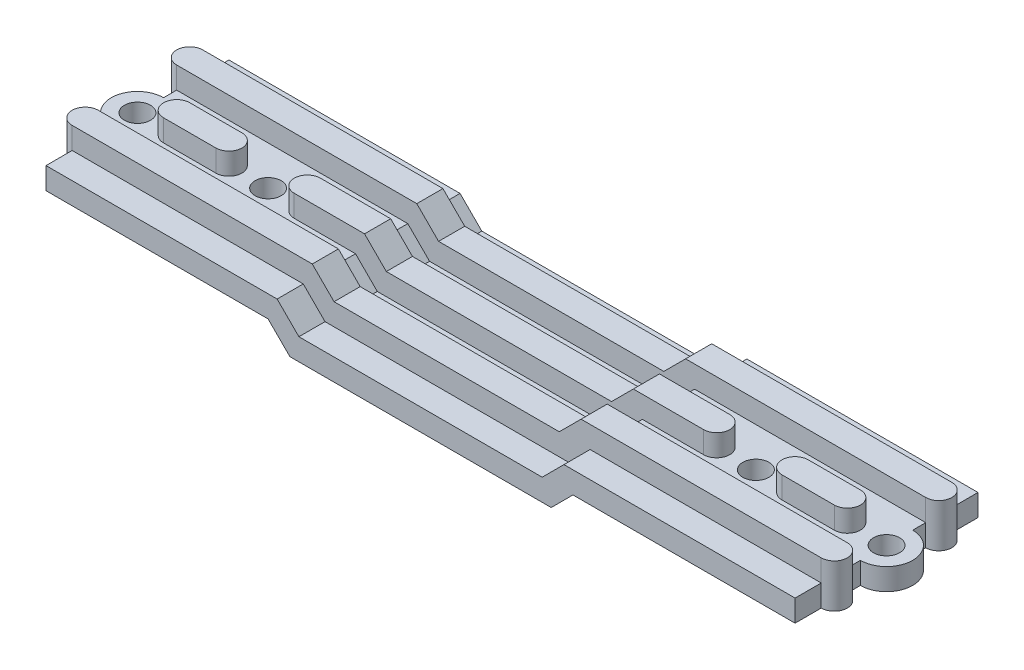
ISO-10303-21;
HEADER;
FILE_DESCRIPTION(('STEP AP214'),'2;1');
FILE_NAME('part.step','',(''),(''),'','','');
FILE_SCHEMA(('AUTOMOTIVE_DESIGN { 1 0 10303 214 1 1 1 1 }'));
ENDSEC;
DATA;
#1=APPLICATION_CONTEXT('core data for automotive mechanical design processes');
#2=APPLICATION_PROTOCOL_DEFINITION('international standard','automotive_design',2000,#1);
#3=PRODUCT_CONTEXT('',#1,'mechanical');
#4=PRODUCT('Part','Part','',(#3));
#5=PRODUCT_RELATED_PRODUCT_CATEGORY('part','',(#4));
#6=PRODUCT_DEFINITION_FORMATION('','',#4);
#7=PRODUCT_DEFINITION_CONTEXT('part definition',#1,'design');
#8=PRODUCT_DEFINITION('design','',#6,#7);
#9=PRODUCT_DEFINITION_SHAPE('','',#8);
#10=(LENGTH_UNIT() NAMED_UNIT(*) SI_UNIT(.MILLI.,.METRE.));
#11=(NAMED_UNIT(*) PLANE_ANGLE_UNIT() SI_UNIT($,.RADIAN.));
#12=(NAMED_UNIT(*) SI_UNIT($,.STERADIAN.) SOLID_ANGLE_UNIT());
#13=UNCERTAINTY_MEASURE_WITH_UNIT(LENGTH_MEASURE(1.E-05),#10,'distance_accuracy_value','');
#14=(GEOMETRIC_REPRESENTATION_CONTEXT(3) GLOBAL_UNCERTAINTY_ASSIGNED_CONTEXT((#13)) GLOBAL_UNIT_ASSIGNED_CONTEXT((#10,
#11,#12)) REPRESENTATION_CONTEXT('',''));
#15=CARTESIAN_POINT('',(0.,0.,0.));
#16=DIRECTION('',(0.,0.,1.));
#17=DIRECTION('',(1.,0.,0.));
#18=AXIS2_PLACEMENT_3D('',#15,#16,#17);
#19=CARTESIAN_POINT('',(32.5,7.50000000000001,0.));
#20=DIRECTION('',(0.,1.,0.));
#21=DIRECTION('',(-1.,0.,0.));
#22=AXIS2_PLACEMENT_3D('',#19,#20,#21);
#23=PLANE('',#22);
#24=CARTESIAN_POINT('',(38.5,7.5,0.));
#25=DIRECTION('',(0.,1.,0.));
#26=DIRECTION('',(-1.,0.,0.));
#27=AXIS2_PLACEMENT_3D('',#24,#25,#26);
#28=CIRCLE('',#27,1.5);
#29=CARTESIAN_POINT('',(38.5,7.5,-1.49999999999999));
#30=VERTEX_POINT('',#29);
#31=CARTESIAN_POINT('',(38.5,7.5,1.50000000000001));
#32=VERTEX_POINT('',#31);
#33=EDGE_CURVE('E641',#30,#32,#28,.F.);
#34=ORIENTED_EDGE('',*,*,#33,.F.);
#35=DIRECTION('',(-1.,0.,0.));
#36=VECTOR('',#35,1.);
#37=CARTESIAN_POINT('',(32.5,7.50000000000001,-1.49999999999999));
#38=LINE('',#37,#36);
#39=CARTESIAN_POINT('',(32.5,7.50000000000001,-1.49999999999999));
#40=VERTEX_POINT('',#39);
#41=EDGE_CURVE('E433',#40,#30,#38,.F.);
#42=ORIENTED_EDGE('',*,*,#41,.F.);
#43=CARTESIAN_POINT('',(32.5,7.50000000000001,0.));
#44=DIRECTION('',(0.,1.,0.));
#45=DIRECTION('',(-1.,0.,0.));
#46=AXIS2_PLACEMENT_3D('',#43,#44,#45);
#47=CIRCLE('',#46,1.5);
#48=CARTESIAN_POINT('',(32.5,7.5,1.50000000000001));
#49=VERTEX_POINT('',#48);
#50=EDGE_CURVE('E639',#49,#40,#47,.F.);
#51=ORIENTED_EDGE('',*,*,#50,.F.);
#52=DIRECTION('',(1.,0.,0.));
#53=VECTOR('',#52,1.);
#54=CARTESIAN_POINT('',(32.5,7.5,1.50000000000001));
#55=LINE('',#54,#53);
#56=EDGE_CURVE('E532',#32,#49,#55,.F.);
#57=ORIENTED_EDGE('',*,*,#56,.F.);
#58=EDGE_LOOP('',(#34,#42,#51,#57));
#59=FACE_BOUND('',#58,.T.);
#60=ADVANCED_FACE('F17',(#59),#23,.T.);
#61=CARTESIAN_POINT('',(-38.5,7.49999999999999,0.));
#62=DIRECTION('',(0.,1.,0.));
#63=DIRECTION('',(-1.,0.,0.));
#64=AXIS2_PLACEMENT_3D('',#61,#62,#63);
#65=PLANE('',#64);
#66=CARTESIAN_POINT('',(-32.5,7.49999999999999,0.));
#67=DIRECTION('',(0.,1.,0.));
#68=DIRECTION('',(-1.,0.,0.));
#69=AXIS2_PLACEMENT_3D('',#66,#67,#68);
#70=CIRCLE('',#69,1.5);
#71=CARTESIAN_POINT('',(-32.5,7.49999999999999,-1.49999999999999));
#72=VERTEX_POINT('',#71);
#73=CARTESIAN_POINT('',(-32.5,7.49999999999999,1.50000000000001));
#74=VERTEX_POINT('',#73);
#75=EDGE_CURVE('E633',#72,#74,#70,.F.);
#76=ORIENTED_EDGE('',*,*,#75,.F.);
#77=DIRECTION('',(-1.,0.,0.));
#78=VECTOR('',#77,1.);
#79=CARTESIAN_POINT('',(-38.5,7.49999999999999,-1.49999999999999));
#80=LINE('',#79,#78);
#81=CARTESIAN_POINT('',(-38.5,7.49999999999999,-1.49999999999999));
#82=VERTEX_POINT('',#81);
#83=EDGE_CURVE('E521',#82,#72,#80,.F.);
#84=ORIENTED_EDGE('',*,*,#83,.F.);
#85=CARTESIAN_POINT('',(-38.5,7.49999999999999,0.));
#86=DIRECTION('',(0.,1.,0.));
#87=DIRECTION('',(-1.,0.,0.));
#88=AXIS2_PLACEMENT_3D('',#85,#86,#87);
#89=CIRCLE('',#88,1.5);
#90=CARTESIAN_POINT('',(-38.5,7.49999999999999,1.50000000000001));
#91=VERTEX_POINT('',#90);
#92=EDGE_CURVE('E637',#91,#82,#89,.F.);
#93=ORIENTED_EDGE('',*,*,#92,.F.);
#94=DIRECTION('',(1.,0.,0.));
#95=VECTOR('',#94,1.);
#96=CARTESIAN_POINT('',(-38.5,7.49999999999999,1.50000000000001));
#97=LINE('',#96,#95);
#98=EDGE_CURVE('E525',#74,#91,#97,.F.);
#99=ORIENTED_EDGE('',*,*,#98,.F.);
#100=EDGE_LOOP('',(#76,#84,#93,#99));
#101=FACE_BOUND('',#100,.T.);
#102=ADVANCED_FACE('F1771',(#101),#65,.T.);
#103=CARTESIAN_POINT('',(-12.9289321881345,5.,116.563777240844));
#104=DIRECTION('',(0.,1.,0.));
#105=DIRECTION('',(-1.,0.,0.));
#106=AXIS2_PLACEMENT_3D('',#103,#104,#105);
#107=PLANE('',#106);
#108=DIRECTION('',(-1.,0.,0.));
#109=VECTOR('',#108,1.);
#110=CARTESIAN_POINT('',(23.5,5.,-1.49999999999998));
#111=LINE('',#110,#109);
#112=CARTESIAN_POINT('',(-12.9289321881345,5.,-1.49999999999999));
#113=VERTEX_POINT('',#112);
#114=CARTESIAN_POINT('',(12.9289321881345,5.,-1.49999999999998));
#115=VERTEX_POINT('',#114);
#116=EDGE_CURVE('E478',#113,#115,#111,.F.);
#117=ORIENTED_EDGE('',*,*,#116,.F.);
#118=DIRECTION('',(0.,0.,1.));
#119=VECTOR('',#118,1.);
#120=CARTESIAN_POINT('',(-12.9289321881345,5.,116.563777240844));
#121=LINE('',#120,#119);
#122=CARTESIAN_POINT('',(-12.9289321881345,5.,1.49999999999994));
#123=VERTEX_POINT('',#122);
#124=EDGE_CURVE('E463',#123,#113,#121,.F.);
#125=ORIENTED_EDGE('',*,*,#124,.F.);
#126=DIRECTION('',(1.,0.,0.));
#127=VECTOR('',#126,1.);
#128=CARTESIAN_POINT('',(23.5,5.,1.49999999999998));
#129=LINE('',#128,#127);
#130=CARTESIAN_POINT('',(12.9289321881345,5.,1.49999999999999));
#131=VERTEX_POINT('',#130);
#132=EDGE_CURVE('E511',#131,#123,#129,.F.);
#133=ORIENTED_EDGE('',*,*,#132,.F.);
#134=DIRECTION('',(0.,0.,1.));
#135=VECTOR('',#134,1.);
#136=CARTESIAN_POINT('',(12.9289321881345,5.,116.563777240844));
#137=LINE('',#136,#135);
#138=EDGE_CURVE('E474',#115,#131,#137,.T.);
#139=ORIENTED_EDGE('',*,*,#138,.F.);
#140=EDGE_LOOP('',(#117,#125,#133,#139));
#141=FACE_BOUND('',#140,.T.);
#142=ADVANCED_FACE('F1762',(#141),#107,.T.);
#143=CARTESIAN_POINT('',(12.9289321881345,5.,116.563777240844));
#144=DIRECTION('',(-0.707106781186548,0.707106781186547,0.));
#145=DIRECTION('',(-0.707106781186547,-0.707106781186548,0.));
#146=AXIS2_PLACEMENT_3D('',#143,#144,#145);
#147=PLANE('',#146);
#148=DIRECTION('',(0.707106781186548,0.707106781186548,0.));
#149=VECTOR('',#148,1.);
#150=CARTESIAN_POINT('',(12.9289321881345,5.,-1.49999999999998));
#151=LINE('',#150,#149);
#152=CARTESIAN_POINT('',(15.4289321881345,7.49999999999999,-1.49999999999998));
#153=VERTEX_POINT('',#152);
#154=EDGE_CURVE('E421',#115,#153,#151,.T.);
#155=ORIENTED_EDGE('',*,*,#154,.F.);
#156=ORIENTED_EDGE('',*,*,#138,.T.);
#157=DIRECTION('',(-0.707106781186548,-0.707106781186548,0.));
#158=VECTOR('',#157,1.);
#159=CARTESIAN_POINT('',(15.4289321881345,7.49999999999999,1.49999999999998));
#160=LINE('',#159,#158);
#161=CARTESIAN_POINT('',(15.4289321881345,7.50000000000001,1.49999999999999));
#162=VERTEX_POINT('',#161);
#163=EDGE_CURVE('E499',#162,#131,#160,.T.);
#164=ORIENTED_EDGE('',*,*,#163,.F.);
#165=DIRECTION('',(0.,0.,1.));
#166=VECTOR('',#165,1.);
#167=CARTESIAN_POINT('',(15.4289321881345,7.50000000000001,0.));
#168=LINE('',#167,#166);
#169=EDGE_CURVE('E472',#153,#162,#168,.T.);
#170=ORIENTED_EDGE('',*,*,#169,.F.);
#171=EDGE_LOOP('',(#155,#156,#164,#170));
#172=FACE_BOUND('',#171,.T.);
#173=ADVANCED_FACE('F1754',(#172),#147,.T.);
#174=CARTESIAN_POINT('',(23.5,7.50000000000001,0.));
#175=DIRECTION('',(0.,1.,0.));
#176=DIRECTION('',(-1.,0.,0.));
#177=AXIS2_PLACEMENT_3D('',#174,#175,#176);
#178=PLANE('',#177);
#179=DIRECTION('',(1.,0.,0.));
#180=VECTOR('',#179,1.);
#181=CARTESIAN_POINT('',(23.5,7.50000000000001,1.49999999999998));
#182=LINE('',#181,#180);
#183=CARTESIAN_POINT('',(23.5,7.50000000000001,1.49999999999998));
#184=VERTEX_POINT('',#183);
#185=EDGE_CURVE('E429',#184,#162,#182,.F.);
#186=ORIENTED_EDGE('',*,*,#185,.F.);
#187=CARTESIAN_POINT('',(23.5,7.50000000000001,0.));
#188=DIRECTION('',(0.,1.,0.));
#189=DIRECTION('',(-1.,0.,0.));
#190=AXIS2_PLACEMENT_3D('',#187,#188,#189);
#191=CIRCLE('',#190,1.49999999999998);
#192=CARTESIAN_POINT('',(23.5,7.5,-1.49999999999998));
#193=VERTEX_POINT('',#192);
#194=EDGE_CURVE('E20',#193,#184,#191,.F.);
#195=ORIENTED_EDGE('',*,*,#194,.F.);
#196=DIRECTION('',(-1.,0.,0.));
#197=VECTOR('',#196,1.);
#198=CARTESIAN_POINT('',(23.5,7.49999999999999,-1.49999999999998));
#199=LINE('',#198,#197);
#200=EDGE_CURVE('E413',#153,#193,#199,.F.);
#201=ORIENTED_EDGE('',*,*,#200,.F.);
#202=ORIENTED_EDGE('',*,*,#169,.T.);
#203=EDGE_LOOP('',(#186,#195,#201,#202));
#204=FACE_BOUND('',#203,.T.);
#205=ADVANCED_FACE('F427',(#204),#178,.T.);
#206=CARTESIAN_POINT('',(23.5,7.50000000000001,0.));
#207=DIRECTION('',(0.,1.,0.));
#208=DIRECTION('',(-1.,0.,0.));
#209=AXIS2_PLACEMENT_3D('',#206,#207,#208);
#210=PLANE('',#209);
#211=CARTESIAN_POINT('',(-23.5,7.49999999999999,0.));
#212=DIRECTION('',(0.,1.,0.));
#213=DIRECTION('',(-1.,0.,0.));
#214=AXIS2_PLACEMENT_3D('',#211,#212,#213);
#215=CIRCLE('',#214,1.49999999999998);
#216=CARTESIAN_POINT('',(-23.5,7.49999999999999,1.49999999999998));
#217=VERTEX_POINT('',#216);
#218=CARTESIAN_POINT('',(-23.5,7.49999999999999,-1.49999999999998));
#219=VERTEX_POINT('',#218);
#220=EDGE_CURVE('E485',#217,#219,#215,.F.);
#221=ORIENTED_EDGE('',*,*,#220,.F.);
#222=DIRECTION('',(1.,0.,0.));
#223=VECTOR('',#222,1.);
#224=CARTESIAN_POINT('',(23.5,7.5,1.49999999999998));
#225=LINE('',#224,#223);
#226=CARTESIAN_POINT('',(-15.4289321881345,7.5,1.49999999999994));
#227=VERTEX_POINT('',#226);
#228=EDGE_CURVE('E491',#227,#217,#225,.F.);
#229=ORIENTED_EDGE('',*,*,#228,.F.);
#230=DIRECTION('',(0.,0.,1.));
#231=VECTOR('',#230,1.);
#232=CARTESIAN_POINT('',(-15.4289321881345,7.5,116.563777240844));
#233=LINE('',#232,#231);
#234=CARTESIAN_POINT('',(-15.4289321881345,7.5,-1.49999999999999));
#235=VERTEX_POINT('',#234);
#236=EDGE_CURVE('E434',#235,#227,#233,.T.);
#237=ORIENTED_EDGE('',*,*,#236,.F.);
#238=DIRECTION('',(-1.,0.,0.));
#239=VECTOR('',#238,1.);
#240=CARTESIAN_POINT('',(23.5,7.49999999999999,-1.49999999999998));
#241=LINE('',#240,#239);
#242=EDGE_CURVE('E441',#219,#235,#241,.F.);
#243=ORIENTED_EDGE('',*,*,#242,.F.);
#244=EDGE_LOOP('',(#221,#229,#237,#243));
#245=FACE_BOUND('',#244,.T.);
#246=ADVANCED_FACE('F1737',(#245),#210,.T.);
#247=CARTESIAN_POINT('',(-15.4289321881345,7.5,116.563777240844));
#248=DIRECTION('',(0.707106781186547,0.707106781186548,0.));
#249=DIRECTION('',(-0.707106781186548,0.707106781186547,0.));
#250=AXIS2_PLACEMENT_3D('',#247,#248,#249);
#251=PLANE('',#250);
#252=DIRECTION('',(0.707106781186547,-0.707106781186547,0.));
#253=VECTOR('',#252,1.);
#254=CARTESIAN_POINT('',(-15.4289321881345,7.5,-1.49999999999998));
#255=LINE('',#254,#253);
#256=EDGE_CURVE('E459',#235,#113,#255,.T.);
#257=ORIENTED_EDGE('',*,*,#256,.F.);
#258=ORIENTED_EDGE('',*,*,#236,.T.);
#259=DIRECTION('',(-0.707106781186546,0.707106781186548,0.));
#260=VECTOR('',#259,1.);
#261=CARTESIAN_POINT('',(-12.9289321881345,5.,1.49999999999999));
#262=LINE('',#261,#260);
#263=EDGE_CURVE('E495',#123,#227,#262,.T.);
#264=ORIENTED_EDGE('',*,*,#263,.F.);
#265=ORIENTED_EDGE('',*,*,#124,.T.);
#266=EDGE_LOOP('',(#257,#258,#264,#265));
#267=FACE_BOUND('',#266,.T.);
#268=ADVANCED_FACE('F1729',(#267),#251,.T.);
#269=CARTESIAN_POINT('',(23.5,2.5,0.));
#270=DIRECTION('',(0.,1.,0.));
#271=DIRECTION('',(-1.,0.,0.));
#272=AXIS2_PLACEMENT_3D('',#269,#270,#271);
#273=CYLINDRICAL_SURFACE('',#272,1.49999999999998);
#274=DIRECTION('',(0.,1.,0.));
#275=VECTOR('',#274,1.);
#276=CARTESIAN_POINT('',(23.5,2.5,-1.49999999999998));
#277=LINE('',#276,#275);
#278=CARTESIAN_POINT('',(23.5,5.,-1.49999999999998));
#279=VERTEX_POINT('',#278);
#280=EDGE_CURVE('E418',#193,#279,#277,.F.);
#281=ORIENTED_EDGE('',*,*,#280,.F.);
#282=ORIENTED_EDGE('',*,*,#194,.T.);
#283=DIRECTION('',(0.,1.,0.));
#284=VECTOR('',#283,1.);
#285=CARTESIAN_POINT('',(23.5,2.5,1.49999999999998));
#286=LINE('',#285,#284);
#287=CARTESIAN_POINT('',(23.5,5.,1.49999999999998));
#288=VERTEX_POINT('',#287);
#289=EDGE_CURVE('E653',#288,#184,#286,.T.);
#290=ORIENTED_EDGE('',*,*,#289,.F.);
#291=CARTESIAN_POINT('',(23.5,5.,0.));
#292=DIRECTION('',(0.,1.,0.));
#293=DIRECTION('',(-1.,0.,0.));
#294=AXIS2_PLACEMENT_3D('',#291,#292,#293);
#295=CIRCLE('',#294,1.49999999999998);
#296=EDGE_CURVE('E437',#279,#288,#295,.F.);
#297=ORIENTED_EDGE('',*,*,#296,.F.);
#298=EDGE_LOOP('',(#281,#282,#290,#297));
#299=FACE_BOUND('',#298,.T.);
#300=ADVANCED_FACE('F436',(#299),#273,.T.);
#301=CARTESIAN_POINT('',(32.5,2.5,-1.49999999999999));
#302=DIRECTION('',(0.,0.,-1.));
#303=DIRECTION('',(-1.,0.,0.));
#304=AXIS2_PLACEMENT_3D('',#301,#302,#303);
#305=PLANE('',#304);
#306=DIRECTION('',(0.,1.,0.));
#307=VECTOR('',#306,1.);
#308=CARTESIAN_POINT('',(32.5,2.5,-1.49999999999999));
#309=LINE('',#308,#307);
#310=CARTESIAN_POINT('',(32.5,5.00000000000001,-1.49999999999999));
#311=VERTEX_POINT('',#310);
#312=EDGE_CURVE('E640',#40,#311,#309,.F.);
#313=ORIENTED_EDGE('',*,*,#312,.F.);
#314=ORIENTED_EDGE('',*,*,#41,.T.);
#315=DIRECTION('',(0.,1.,0.));
#316=VECTOR('',#315,1.);
#317=CARTESIAN_POINT('',(38.5,2.5,-1.49999999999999));
#318=LINE('',#317,#316);
#319=CARTESIAN_POINT('',(38.5,5.,-1.49999999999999));
#320=VERTEX_POINT('',#319);
#321=EDGE_CURVE('E531',#320,#30,#318,.T.);
#322=ORIENTED_EDGE('',*,*,#321,.F.);
#323=DIRECTION('',(-1.,0.,0.));
#324=VECTOR('',#323,1.);
#325=CARTESIAN_POINT('',(17.5,5.,-1.49999999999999));
#326=LINE('',#325,#324);
#327=EDGE_CURVE('E627',#311,#320,#326,.F.);
#328=ORIENTED_EDGE('',*,*,#327,.F.);
#329=EDGE_LOOP('',(#313,#314,#322,#328));
#330=FACE_BOUND('',#329,.T.);
#331=ADVANCED_FACE('F702',(#330),#305,.T.);
#332=CARTESIAN_POINT('',(38.5,2.5,0.));
#333=DIRECTION('',(0.,1.,0.));
#334=DIRECTION('',(-1.,0.,0.));
#335=AXIS2_PLACEMENT_3D('',#332,#333,#334);
#336=CYLINDRICAL_SURFACE('',#335,1.5);
#337=ORIENTED_EDGE('',*,*,#321,.T.);
#338=ORIENTED_EDGE('',*,*,#33,.T.);
#339=DIRECTION('',(0.,1.,0.));
#340=VECTOR('',#339,1.);
#341=CARTESIAN_POINT('',(38.5,2.5,1.50000000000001));
#342=LINE('',#341,#340);
#343=CARTESIAN_POINT('',(38.5,5.00000000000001,1.50000000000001));
#344=VERTEX_POINT('',#343);
#345=EDGE_CURVE('E536',#344,#32,#342,.T.);
#346=ORIENTED_EDGE('',*,*,#345,.F.);
#347=CARTESIAN_POINT('',(38.5,5.,0.));
#348=DIRECTION('',(0.,1.,0.));
#349=DIRECTION('',(-1.,0.,0.));
#350=AXIS2_PLACEMENT_3D('',#347,#348,#349);
#351=CIRCLE('',#350,1.5);
#352=EDGE_CURVE('E625',#320,#344,#351,.F.);
#353=ORIENTED_EDGE('',*,*,#352,.F.);
#354=EDGE_LOOP('',(#337,#338,#346,#353));
#355=FACE_BOUND('',#354,.T.);
#356=ADVANCED_FACE('F1707',(#355),#336,.T.);
#357=CARTESIAN_POINT('',(32.5,2.5,1.50000000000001));
#358=DIRECTION('',(0.,0.,1.));
#359=DIRECTION('',(1.,0.,0.));
#360=AXIS2_PLACEMENT_3D('',#357,#358,#359);
#361=PLANE('',#360);
#362=ORIENTED_EDGE('',*,*,#345,.T.);
#363=ORIENTED_EDGE('',*,*,#56,.T.);
#364=DIRECTION('',(0.,1.,0.));
#365=VECTOR('',#364,1.);
#366=CARTESIAN_POINT('',(32.5,2.5,1.50000000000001));
#367=LINE('',#366,#365);
#368=CARTESIAN_POINT('',(32.5,5.,1.50000000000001));
#369=VERTEX_POINT('',#368);
#370=EDGE_CURVE('E535',#369,#49,#367,.T.);
#371=ORIENTED_EDGE('',*,*,#370,.F.);
#372=DIRECTION('',(-1.,0.,0.));
#373=VECTOR('',#372,1.);
#374=CARTESIAN_POINT('',(17.5,5.,1.50000000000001));
#375=LINE('',#374,#373);
#376=EDGE_CURVE('E624',#344,#369,#375,.T.);
#377=ORIENTED_EDGE('',*,*,#376,.F.);
#378=EDGE_LOOP('',(#362,#363,#371,#377));
#379=FACE_BOUND('',#378,.T.);
#380=ADVANCED_FACE('F696',(#379),#361,.T.);
#381=CARTESIAN_POINT('',(32.5,2.5,0.));
#382=DIRECTION('',(0.,1.,0.));
#383=DIRECTION('',(-1.,0.,0.));
#384=AXIS2_PLACEMENT_3D('',#381,#382,#383);
#385=CYLINDRICAL_SURFACE('',#384,1.5);
#386=ORIENTED_EDGE('',*,*,#50,.T.);
#387=ORIENTED_EDGE('',*,*,#312,.T.);
#388=CARTESIAN_POINT('',(32.5,5.,0.));
#389=DIRECTION('',(0.,1.,0.));
#390=DIRECTION('',(-1.,0.,0.));
#391=AXIS2_PLACEMENT_3D('',#388,#389,#390);
#392=CIRCLE('',#391,1.5);
#393=EDGE_CURVE('E620',#369,#311,#392,.F.);
#394=ORIENTED_EDGE('',*,*,#393,.F.);
#395=ORIENTED_EDGE('',*,*,#370,.T.);
#396=EDGE_LOOP('',(#386,#387,#394,#395));
#397=FACE_BOUND('',#396,.T.);
#398=ADVANCED_FACE('F691',(#397),#385,.T.);
#399=CARTESIAN_POINT('',(13.2322330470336,1.76776695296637,10.5));
#400=DIRECTION('',(-0.707106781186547,0.707106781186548,0.));
#401=DIRECTION('',(-0.707106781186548,-0.707106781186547,0.));
#402=AXIS2_PLACEMENT_3D('',#399,#400,#401);
#403=PLANE('',#402);
#404=DIRECTION('',(-0.707106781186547,-0.707106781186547,0.));
#405=VECTOR('',#404,1.);
#406=CARTESIAN_POINT('',(16.4644660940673,5.,4.49999999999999));
#407=LINE('',#406,#405);
#408=CARTESIAN_POINT('',(16.4644660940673,5.,4.49999999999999));
#409=VERTEX_POINT('',#408);
#410=CARTESIAN_POINT('',(13.9644660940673,2.5,4.49999999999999));
#411=VERTEX_POINT('',#410);
#412=EDGE_CURVE('E673',#409,#411,#407,.T.);
#413=ORIENTED_EDGE('',*,*,#412,.F.);
#414=DIRECTION('',(0.,0.,1.));
#415=VECTOR('',#414,1.);
#416=CARTESIAN_POINT('',(16.4644660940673,5.,10.5));
#417=LINE('',#416,#415);
#418=CARTESIAN_POINT('',(16.4644660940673,5.,1.49999999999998));
#419=VERTEX_POINT('',#418);
#420=EDGE_CURVE('E668',#419,#409,#417,.T.);
#421=ORIENTED_EDGE('',*,*,#420,.F.);
#422=DIRECTION('',(0.707106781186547,0.707106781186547,0.));
#423=VECTOR('',#422,1.);
#424=CARTESIAN_POINT('',(13.9644660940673,2.5,1.49999999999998));
#425=LINE('',#424,#423);
#426=CARTESIAN_POINT('',(13.9644660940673,2.5,1.49999999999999));
#427=VERTEX_POINT('',#426);
#428=EDGE_CURVE('E506',#427,#419,#425,.T.);
#429=ORIENTED_EDGE('',*,*,#428,.F.);
#430=DIRECTION('',(0.,0.,1.));
#431=VECTOR('',#430,1.);
#432=CARTESIAN_POINT('',(13.9644660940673,2.5,10.5));
#433=LINE('',#432,#431);
#434=EDGE_CURVE('E529',#411,#427,#433,.F.);
#435=ORIENTED_EDGE('',*,*,#434,.F.);
#436=EDGE_LOOP('',(#413,#421,#429,#435));
#437=FACE_BOUND('',#436,.T.);
#438=ADVANCED_FACE('F672',(#437),#403,.T.);
#439=CARTESIAN_POINT('',(15.,2.5,10.5));
#440=DIRECTION('',(0.,1.,0.));
#441=DIRECTION('',(0.,0.,1.));
#442=AXIS2_PLACEMENT_3D('',#439,#440,#441);
#443=PLANE('',#442);
#444=DIRECTION('',(-1.,0.,0.));
#445=VECTOR('',#444,1.);
#446=CARTESIAN_POINT('',(43.,2.5,4.49999999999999));
#447=LINE('',#446,#445);
#448=CARTESIAN_POINT('',(-13.9644660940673,2.5,4.49999999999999));
#449=VERTEX_POINT('',#448);
#450=EDGE_CURVE('E828',#411,#449,#447,.T.);
#451=ORIENTED_EDGE('',*,*,#450,.F.);
#452=ORIENTED_EDGE('',*,*,#434,.T.);
#453=DIRECTION('',(1.,0.,0.));
#454=VECTOR('',#453,1.);
#455=CARTESIAN_POINT('',(23.5,2.5,1.49999999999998));
#456=LINE('',#455,#454);
#457=CARTESIAN_POINT('',(-13.9644660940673,2.5,1.49999999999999));
#458=VERTEX_POINT('',#457);
#459=EDGE_CURVE('E503',#458,#427,#456,.T.);
#460=ORIENTED_EDGE('',*,*,#459,.F.);
#461=DIRECTION('',(0.,0.,1.));
#462=VECTOR('',#461,1.);
#463=CARTESIAN_POINT('',(-13.9644660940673,2.5,10.5));
#464=LINE('',#463,#462);
#465=EDGE_CURVE('E500',#449,#458,#464,.F.);
#466=ORIENTED_EDGE('',*,*,#465,.F.);
#467=EDGE_LOOP('',(#451,#452,#460,#466));
#468=FACE_BOUND('',#467,.T.);
#469=ADVANCED_FACE('F862',(#468),#443,.T.);
#470=CARTESIAN_POINT('',(-38.5,2.5,1.50000000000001));
#471=DIRECTION('',(0.,0.,1.));
#472=DIRECTION('',(1.,0.,0.));
#473=AXIS2_PLACEMENT_3D('',#470,#471,#472);
#474=PLANE('',#473);
#475=DIRECTION('',(0.,1.,0.));
#476=VECTOR('',#475,1.);
#477=CARTESIAN_POINT('',(-32.5,2.5,1.50000000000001));
#478=LINE('',#477,#476);
#479=CARTESIAN_POINT('',(-32.5,4.99999999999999,1.50000000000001));
#480=VERTEX_POINT('',#479);
#481=EDGE_CURVE('E523',#74,#480,#478,.F.);
#482=ORIENTED_EDGE('',*,*,#481,.F.);
#483=ORIENTED_EDGE('',*,*,#98,.T.);
#484=DIRECTION('',(0.,1.,0.));
#485=VECTOR('',#484,1.);
#486=CARTESIAN_POINT('',(-38.5,2.5,1.50000000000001));
#487=LINE('',#486,#485);
#488=CARTESIAN_POINT('',(-38.5,4.99999999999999,1.50000000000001));
#489=VERTEX_POINT('',#488);
#490=EDGE_CURVE('E528',#489,#91,#487,.T.);
#491=ORIENTED_EDGE('',*,*,#490,.F.);
#492=DIRECTION('',(-1.,0.,0.));
#493=VECTOR('',#492,1.);
#494=CARTESIAN_POINT('',(-17.5,4.99999999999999,1.50000000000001));
#495=LINE('',#494,#493);
#496=EDGE_CURVE('E619',#480,#489,#495,.T.);
#497=ORIENTED_EDGE('',*,*,#496,.F.);
#498=EDGE_LOOP('',(#482,#483,#491,#497));
#499=FACE_BOUND('',#498,.T.);
#500=ADVANCED_FACE('F1669',(#499),#474,.T.);
#501=CARTESIAN_POINT('',(-38.5,2.5,0.));
#502=DIRECTION('',(0.,1.,0.));
#503=DIRECTION('',(-1.,0.,0.));
#504=AXIS2_PLACEMENT_3D('',#501,#502,#503);
#505=CYLINDRICAL_SURFACE('',#504,1.5);
#506=ORIENTED_EDGE('',*,*,#92,.T.);
#507=DIRECTION('',(0.,1.,0.));
#508=VECTOR('',#507,1.);
#509=CARTESIAN_POINT('',(-38.5,2.5,-1.49999999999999));
#510=LINE('',#509,#508);
#511=CARTESIAN_POINT('',(-38.5,4.99999999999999,-1.49999999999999));
#512=VERTEX_POINT('',#511);
#513=EDGE_CURVE('E524',#512,#82,#510,.T.);
#514=ORIENTED_EDGE('',*,*,#513,.F.);
#515=CARTESIAN_POINT('',(-38.5,4.99999999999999,0.));
#516=DIRECTION('',(0.,1.,0.));
#517=DIRECTION('',(-1.,0.,0.));
#518=AXIS2_PLACEMENT_3D('',#515,#516,#517);
#519=CIRCLE('',#518,1.5);
#520=EDGE_CURVE('E617',#489,#512,#519,.F.);
#521=ORIENTED_EDGE('',*,*,#520,.F.);
#522=ORIENTED_EDGE('',*,*,#490,.T.);
#523=EDGE_LOOP('',(#506,#514,#521,#522));
#524=FACE_BOUND('',#523,.T.);
#525=ADVANCED_FACE('F1660',(#524),#505,.T.);
#526=CARTESIAN_POINT('',(-38.5,2.5,-1.49999999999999));
#527=DIRECTION('',(0.,0.,-1.));
#528=DIRECTION('',(-1.,0.,0.));
#529=AXIS2_PLACEMENT_3D('',#526,#527,#528);
#530=PLANE('',#529);
#531=ORIENTED_EDGE('',*,*,#513,.T.);
#532=ORIENTED_EDGE('',*,*,#83,.T.);
#533=DIRECTION('',(0.,1.,0.));
#534=VECTOR('',#533,1.);
#535=CARTESIAN_POINT('',(-32.5,2.5,-1.49999999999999));
#536=LINE('',#535,#534);
#537=CARTESIAN_POINT('',(-32.5,4.99999999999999,-1.49999999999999));
#538=VERTEX_POINT('',#537);
#539=EDGE_CURVE('E636',#538,#72,#536,.T.);
#540=ORIENTED_EDGE('',*,*,#539,.F.);
#541=DIRECTION('',(-1.,0.,0.));
#542=VECTOR('',#541,1.);
#543=CARTESIAN_POINT('',(-17.5,4.99999999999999,-1.49999999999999));
#544=LINE('',#543,#542);
#545=EDGE_CURVE('E616',#512,#538,#544,.F.);
#546=ORIENTED_EDGE('',*,*,#545,.F.);
#547=EDGE_LOOP('',(#531,#532,#540,#546));
#548=FACE_BOUND('',#547,.T.);
#549=ADVANCED_FACE('F1651',(#548),#530,.T.);
#550=CARTESIAN_POINT('',(-32.5,2.5,0.));
#551=DIRECTION('',(0.,1.,0.));
#552=DIRECTION('',(-1.,0.,0.));
#553=AXIS2_PLACEMENT_3D('',#550,#551,#552);
#554=CYLINDRICAL_SURFACE('',#553,1.5);
#555=ORIENTED_EDGE('',*,*,#539,.T.);
#556=ORIENTED_EDGE('',*,*,#75,.T.);
#557=ORIENTED_EDGE('',*,*,#481,.T.);
#558=CARTESIAN_POINT('',(-32.5,4.99999999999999,0.));
#559=DIRECTION('',(0.,1.,0.));
#560=DIRECTION('',(-1.,0.,0.));
#561=AXIS2_PLACEMENT_3D('',#558,#559,#560);
#562=CIRCLE('',#561,1.5);
#563=EDGE_CURVE('E612',#538,#480,#562,.F.);
#564=ORIENTED_EDGE('',*,*,#563,.F.);
#565=EDGE_LOOP('',(#555,#556,#557,#564));
#566=FACE_BOUND('',#565,.T.);
#567=ADVANCED_FACE('F1643',(#566),#554,.T.);
#568=CARTESIAN_POINT('',(-13.2322330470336,1.76776695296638,10.5));
#569=DIRECTION('',(0.707106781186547,0.707106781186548,0.));
#570=DIRECTION('',(-0.707106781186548,0.707106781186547,0.));
#571=AXIS2_PLACEMENT_3D('',#568,#569,#570);
#572=PLANE('',#571);
#573=DIRECTION('',(-0.707106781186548,0.707106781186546,0.));
#574=VECTOR('',#573,1.);
#575=CARTESIAN_POINT('',(-13.9644660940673,2.5,4.49999999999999));
#576=LINE('',#575,#574);
#577=CARTESIAN_POINT('',(-16.4644660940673,4.99999999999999,4.49999999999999));
#578=VERTEX_POINT('',#577);
#579=EDGE_CURVE('E826',#449,#578,#576,.T.);
#580=ORIENTED_EDGE('',*,*,#579,.F.);
#581=ORIENTED_EDGE('',*,*,#465,.T.);
#582=DIRECTION('',(0.707106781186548,-0.707106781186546,0.));
#583=VECTOR('',#582,1.);
#584=CARTESIAN_POINT('',(-16.4644660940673,5.,1.49999999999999));
#585=LINE('',#584,#583);
#586=CARTESIAN_POINT('',(-16.4644660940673,4.99999999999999,1.49999999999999));
#587=VERTEX_POINT('',#586);
#588=EDGE_CURVE('E494',#587,#458,#585,.T.);
#589=ORIENTED_EDGE('',*,*,#588,.F.);
#590=DIRECTION('',(0.,0.,1.));
#591=VECTOR('',#590,1.);
#592=CARTESIAN_POINT('',(-16.4644660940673,4.99999999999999,10.5));
#593=LINE('',#592,#591);
#594=EDGE_CURVE('E817',#578,#587,#593,.F.);
#595=ORIENTED_EDGE('',*,*,#594,.F.);
#596=EDGE_LOOP('',(#580,#581,#589,#595));
#597=FACE_BOUND('',#596,.T.);
#598=ADVANCED_FACE('F867',(#597),#572,.T.);
#599=CARTESIAN_POINT('',(23.5,2.5,1.49999999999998));
#600=DIRECTION('',(0.,0.,1.));
#601=DIRECTION('',(1.,0.,0.));
#602=AXIS2_PLACEMENT_3D('',#599,#600,#601);
#603=PLANE('',#602);
#604=DIRECTION('',(-1.,0.,0.));
#605=VECTOR('',#604,1.);
#606=CARTESIAN_POINT('',(17.5,5.,1.49999999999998));
#607=LINE('',#606,#605);
#608=EDGE_CURVE('E629',#288,#419,#607,.T.);
#609=ORIENTED_EDGE('',*,*,#608,.F.);
#610=ORIENTED_EDGE('',*,*,#289,.T.);
#611=ORIENTED_EDGE('',*,*,#185,.T.);
#612=ORIENTED_EDGE('',*,*,#163,.T.);
#613=ORIENTED_EDGE('',*,*,#132,.T.);
#614=ORIENTED_EDGE('',*,*,#263,.T.);
#615=ORIENTED_EDGE('',*,*,#228,.T.);
#616=DIRECTION('',(0.,1.,0.));
#617=VECTOR('',#616,1.);
#618=CARTESIAN_POINT('',(-23.5,2.5,1.49999999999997));
#619=LINE('',#618,#617);
#620=CARTESIAN_POINT('',(-23.5,4.99999999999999,1.49999999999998));
#621=VERTEX_POINT('',#620);
#622=EDGE_CURVE('E632',#621,#217,#619,.T.);
#623=ORIENTED_EDGE('',*,*,#622,.F.);
#624=DIRECTION('',(-1.,0.,0.));
#625=VECTOR('',#624,1.);
#626=CARTESIAN_POINT('',(-17.5,4.99999999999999,1.49999999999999));
#627=LINE('',#626,#625);
#628=EDGE_CURVE('E611',#587,#621,#627,.T.);
#629=ORIENTED_EDGE('',*,*,#628,.F.);
#630=ORIENTED_EDGE('',*,*,#588,.T.);
#631=ORIENTED_EDGE('',*,*,#459,.T.);
#632=ORIENTED_EDGE('',*,*,#428,.T.);
#633=EDGE_LOOP('',(#609,#610,#611,#612,#613,#614,#615,#623,#629,#630,#631,#632));
#634=FACE_BOUND('',#633,.T.);
#635=ADVANCED_FACE('F658',(#634),#603,.T.);
#636=CARTESIAN_POINT('',(-23.5,2.5,0.));
#637=DIRECTION('',(0.,1.,0.));
#638=DIRECTION('',(-1.,0.,0.));
#639=AXIS2_PLACEMENT_3D('',#636,#637,#638);
#640=CYLINDRICAL_SURFACE('',#639,1.49999999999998);
#641=ORIENTED_EDGE('',*,*,#220,.T.);
#642=DIRECTION('',(0.,1.,0.));
#643=VECTOR('',#642,1.);
#644=CARTESIAN_POINT('',(-23.5,2.5,-1.49999999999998));
#645=LINE('',#644,#643);
#646=CARTESIAN_POINT('',(-23.5,4.99999999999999,-1.49999999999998));
#647=VERTEX_POINT('',#646);
#648=EDGE_CURVE('E438',#647,#219,#645,.T.);
#649=ORIENTED_EDGE('',*,*,#648,.F.);
#650=CARTESIAN_POINT('',(-23.5,4.99999999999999,0.));
#651=DIRECTION('',(0.,1.,0.));
#652=DIRECTION('',(-1.,0.,0.));
#653=AXIS2_PLACEMENT_3D('',#650,#651,#652);
#654=CIRCLE('',#653,1.49999999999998);
#655=EDGE_CURVE('E608',#621,#647,#654,.F.);
#656=ORIENTED_EDGE('',*,*,#655,.F.);
#657=ORIENTED_EDGE('',*,*,#622,.T.);
#658=EDGE_LOOP('',(#641,#649,#656,#657));
#659=FACE_BOUND('',#658,.T.);
#660=ADVANCED_FACE('F1620',(#659),#640,.T.);
#661=CARTESIAN_POINT('',(23.5,2.5,-1.49999999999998));
#662=DIRECTION('',(0.,0.,-1.));
#663=DIRECTION('',(-1.,0.,0.));
#664=AXIS2_PLACEMENT_3D('',#661,#662,#663);
#665=PLANE('',#664);
#666=ORIENTED_EDGE('',*,*,#242,.T.);
#667=ORIENTED_EDGE('',*,*,#256,.T.);
#668=ORIENTED_EDGE('',*,*,#116,.T.);
#669=ORIENTED_EDGE('',*,*,#154,.T.);
#670=ORIENTED_EDGE('',*,*,#200,.T.);
#671=ORIENTED_EDGE('',*,*,#280,.T.);
#672=DIRECTION('',(-1.,0.,0.));
#673=VECTOR('',#672,1.);
#674=CARTESIAN_POINT('',(17.5,5.,-1.49999999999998));
#675=LINE('',#674,#673);
#676=CARTESIAN_POINT('',(16.4644660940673,5.,-1.49999999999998));
#677=VERTEX_POINT('',#676);
#678=EDGE_CURVE('E630',#677,#279,#675,.F.);
#679=ORIENTED_EDGE('',*,*,#678,.F.);
#680=DIRECTION('',(-0.707106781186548,-0.707106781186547,0.));
#681=VECTOR('',#680,1.);
#682=CARTESIAN_POINT('',(13.2322330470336,1.76776695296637,-1.49999999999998));
#683=LINE('',#682,#681);
#684=CARTESIAN_POINT('',(13.9644660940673,2.5,-1.49999999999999));
#685=VERTEX_POINT('',#684);
#686=EDGE_CURVE('E447',#685,#677,#683,.F.);
#687=ORIENTED_EDGE('',*,*,#686,.F.);
#688=DIRECTION('',(1.,0.,0.));
#689=VECTOR('',#688,1.);
#690=CARTESIAN_POINT('',(15.,2.5,-1.49999999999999));
#691=LINE('',#690,#689);
#692=CARTESIAN_POINT('',(-13.9644660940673,2.5,-1.49999999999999));
#693=VERTEX_POINT('',#692);
#694=EDGE_CURVE('E453',#693,#685,#691,.T.);
#695=ORIENTED_EDGE('',*,*,#694,.F.);
#696=DIRECTION('',(-0.707106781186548,0.707106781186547,0.));
#697=VECTOR('',#696,1.);
#698=CARTESIAN_POINT('',(-13.2322330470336,1.76776695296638,-1.49999999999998));
#699=LINE('',#698,#697);
#700=CARTESIAN_POINT('',(-16.4644660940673,4.99999999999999,-1.49999999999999));
#701=VERTEX_POINT('',#700);
#702=EDGE_CURVE('E455',#701,#693,#699,.F.);
#703=ORIENTED_EDGE('',*,*,#702,.F.);
#704=DIRECTION('',(-1.,0.,0.));
#705=VECTOR('',#704,1.);
#706=CARTESIAN_POINT('',(-17.5,4.99999999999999,-1.49999999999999));
#707=LINE('',#706,#705);
#708=EDGE_CURVE('E610',#647,#701,#707,.F.);
#709=ORIENTED_EDGE('',*,*,#708,.F.);
#710=ORIENTED_EDGE('',*,*,#648,.T.);
#711=EDGE_LOOP('',(#666,#667,#668,#669,#670,#671,#679,#687,#695,#703,#709,#710));
#712=FACE_BOUND('',#711,.T.);
#713=ADVANCED_FACE('F415',(#712),#665,.T.);
#714=CARTESIAN_POINT('',(-13.2322330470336,1.76776695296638,10.5));
#715=DIRECTION('',(0.707106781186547,0.707106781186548,0.));
#716=DIRECTION('',(-0.707106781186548,0.707106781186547,0.));
#717=AXIS2_PLACEMENT_3D('',#714,#715,#716);
#718=PLANE('',#717);
#719=DIRECTION('',(0.707106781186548,-0.707106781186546,0.));
#720=VECTOR('',#719,1.);
#721=CARTESIAN_POINT('',(-16.4644660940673,5.,-4.50000000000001));
#722=LINE('',#721,#720);
#723=CARTESIAN_POINT('',(-16.4644660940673,4.99999999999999,-4.50000000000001));
#724=VERTEX_POINT('',#723);
#725=CARTESIAN_POINT('',(-13.9644660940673,2.5,-4.50000000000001));
#726=VERTEX_POINT('',#725);
#727=EDGE_CURVE('E777',#724,#726,#722,.T.);
#728=ORIENTED_EDGE('',*,*,#727,.F.);
#729=DIRECTION('',(0.,0.,1.));
#730=VECTOR('',#729,1.);
#731=CARTESIAN_POINT('',(-16.4644660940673,4.99999999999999,10.5));
#732=LINE('',#731,#730);
#733=EDGE_CURVE('E788',#701,#724,#732,.F.);
#734=ORIENTED_EDGE('',*,*,#733,.F.);
#735=ORIENTED_EDGE('',*,*,#702,.T.);
#736=DIRECTION('',(0.,0.,1.));
#737=VECTOR('',#736,1.);
#738=CARTESIAN_POINT('',(-13.9644660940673,2.5,10.5));
#739=LINE('',#738,#737);
#740=EDGE_CURVE('E450',#726,#693,#739,.T.);
#741=ORIENTED_EDGE('',*,*,#740,.F.);
#742=EDGE_LOOP('',(#728,#734,#735,#741));
#743=FACE_BOUND('',#742,.T.);
#744=ADVANCED_FACE('F1603',(#743),#718,.T.);
#745=CARTESIAN_POINT('',(15.,2.5,10.5));
#746=DIRECTION('',(0.,1.,0.));
#747=DIRECTION('',(0.,0.,1.));
#748=AXIS2_PLACEMENT_3D('',#745,#746,#747);
#749=PLANE('',#748);
#750=DIRECTION('',(1.,0.,0.));
#751=VECTOR('',#750,1.);
#752=CARTESIAN_POINT('',(43.,2.5,-4.50000000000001));
#753=LINE('',#752,#751);
#754=CARTESIAN_POINT('',(13.9644660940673,2.5,-4.50000000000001));
#755=VERTEX_POINT('',#754);
#756=EDGE_CURVE('E769',#726,#755,#753,.T.);
#757=ORIENTED_EDGE('',*,*,#756,.F.);
#758=ORIENTED_EDGE('',*,*,#740,.T.);
#759=ORIENTED_EDGE('',*,*,#694,.T.);
#760=DIRECTION('',(0.,0.,1.));
#761=VECTOR('',#760,1.);
#762=CARTESIAN_POINT('',(13.9644660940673,2.5,10.5));
#763=LINE('',#762,#761);
#764=EDGE_CURVE('E449',#755,#685,#763,.T.);
#765=ORIENTED_EDGE('',*,*,#764,.F.);
#766=EDGE_LOOP('',(#757,#758,#759,#765));
#767=FACE_BOUND('',#766,.T.);
#768=ADVANCED_FACE('F1108',(#767),#749,.T.);
#769=CARTESIAN_POINT('',(13.2322330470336,1.76776695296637,10.5));
#770=DIRECTION('',(-0.707106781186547,0.707106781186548,0.));
#771=DIRECTION('',(-0.707106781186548,-0.707106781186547,0.));
#772=AXIS2_PLACEMENT_3D('',#769,#770,#771);
#773=PLANE('',#772);
#774=DIRECTION('',(0.707106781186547,0.707106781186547,0.));
#775=VECTOR('',#774,1.);
#776=CARTESIAN_POINT('',(13.9644660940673,2.5,-4.50000000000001));
#777=LINE('',#776,#775);
#778=CARTESIAN_POINT('',(16.4644660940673,5.,-4.50000000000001));
#779=VERTEX_POINT('',#778);
#780=EDGE_CURVE('E766',#755,#779,#777,.T.);
#781=ORIENTED_EDGE('',*,*,#780,.F.);
#782=ORIENTED_EDGE('',*,*,#764,.T.);
#783=ORIENTED_EDGE('',*,*,#686,.T.);
#784=DIRECTION('',(0.,0.,1.));
#785=VECTOR('',#784,1.);
#786=CARTESIAN_POINT('',(16.4644660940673,5.,10.5));
#787=LINE('',#786,#785);
#788=EDGE_CURVE('E712',#779,#677,#787,.T.);
#789=ORIENTED_EDGE('',*,*,#788,.F.);
#790=EDGE_LOOP('',(#781,#782,#783,#789));
#791=FACE_BOUND('',#790,.T.);
#792=ADVANCED_FACE('F1099',(#791),#773,.T.);
#793=CARTESIAN_POINT('',(12.9289321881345,5.,116.563777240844));
#794=DIRECTION('',(-0.707106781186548,0.707106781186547,0.));
#795=DIRECTION('',(-0.707106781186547,-0.707106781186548,0.));
#796=AXIS2_PLACEMENT_3D('',#793,#794,#795);
#797=PLANE('',#796);
#798=DIRECTION('',(0.707106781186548,0.707106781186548,0.));
#799=VECTOR('',#798,1.);
#800=CARTESIAN_POINT('',(12.9289321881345,5.,4.49999999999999));
#801=LINE('',#800,#799);
#802=CARTESIAN_POINT('',(12.9289321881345,5.,4.49999999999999));
#803=VERTEX_POINT('',#802);
#804=CARTESIAN_POINT('',(15.4289321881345,7.49999999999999,4.49999999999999));
#805=VERTEX_POINT('',#804);
#806=EDGE_CURVE('E682',#803,#805,#801,.T.);
#807=ORIENTED_EDGE('',*,*,#806,.F.);
#808=DIRECTION('',(0.,0.,1.));
#809=VECTOR('',#808,1.);
#810=CARTESIAN_POINT('',(12.9289321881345,5.,116.563777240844));
#811=LINE('',#810,#809);
#812=CARTESIAN_POINT('',(12.9289321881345,5.,7.49999999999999));
#813=VERTEX_POINT('',#812);
#814=EDGE_CURVE('E747',#813,#803,#811,.F.);
#815=ORIENTED_EDGE('',*,*,#814,.F.);
#816=DIRECTION('',(-0.707106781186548,-0.707106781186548,0.));
#817=VECTOR('',#816,1.);
#818=CARTESIAN_POINT('',(15.4289321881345,7.49999999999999,7.49999999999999));
#819=LINE('',#818,#817);
#820=CARTESIAN_POINT('',(15.4289321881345,7.50000000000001,7.49999999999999));
#821=VERTEX_POINT('',#820);
#822=EDGE_CURVE('E718',#821,#813,#819,.T.);
#823=ORIENTED_EDGE('',*,*,#822,.F.);
#824=DIRECTION('',(0.,0.,1.));
#825=VECTOR('',#824,1.);
#826=CARTESIAN_POINT('',(15.4289321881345,7.5,5.99999999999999));
#827=LINE('',#826,#825);
#828=EDGE_CURVE('E746',#805,#821,#827,.T.);
#829=ORIENTED_EDGE('',*,*,#828,.F.);
#830=EDGE_LOOP('',(#807,#815,#823,#829));
#831=FACE_BOUND('',#830,.T.);
#832=ADVANCED_FACE('F1097',(#831),#797,.T.);
#833=CARTESIAN_POINT('',(-12.9289321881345,5.,116.563777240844));
#834=DIRECTION('',(0.,1.,0.));
#835=DIRECTION('',(-1.,0.,0.));
#836=AXIS2_PLACEMENT_3D('',#833,#834,#835);
#837=PLANE('',#836);
#838=DIRECTION('',(-1.,0.,0.));
#839=VECTOR('',#838,1.);
#840=CARTESIAN_POINT('',(43.,5.,4.49999999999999));
#841=LINE('',#840,#839);
#842=CARTESIAN_POINT('',(-12.9289321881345,5.,4.49999999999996));
#843=VERTEX_POINT('',#842);
#844=EDGE_CURVE('E685',#843,#803,#841,.F.);
#845=ORIENTED_EDGE('',*,*,#844,.F.);
#846=DIRECTION('',(0.,0.,1.));
#847=VECTOR('',#846,1.);
#848=CARTESIAN_POINT('',(-12.9289321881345,5.,116.563777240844));
#849=LINE('',#848,#847);
#850=CARTESIAN_POINT('',(-12.9289321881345,5.,7.49999999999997));
#851=VERTEX_POINT('',#850);
#852=EDGE_CURVE('E744',#851,#843,#849,.F.);
#853=ORIENTED_EDGE('',*,*,#852,.F.);
#854=DIRECTION('',(1.,0.,0.));
#855=VECTOR('',#854,1.);
#856=CARTESIAN_POINT('',(43.,5.,7.49999999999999));
#857=LINE('',#856,#855);
#858=EDGE_CURVE('E741',#813,#851,#857,.F.);
#859=ORIENTED_EDGE('',*,*,#858,.F.);
#860=ORIENTED_EDGE('',*,*,#814,.T.);
#861=EDGE_LOOP('',(#845,#853,#859,#860));
#862=FACE_BOUND('',#861,.T.);
#863=ADVANCED_FACE('F1092',(#862),#837,.T.);
#864=CARTESIAN_POINT('',(-15.4289321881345,7.5,116.563777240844));
#865=DIRECTION('',(0.707106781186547,0.707106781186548,0.));
#866=DIRECTION('',(-0.707106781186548,0.707106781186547,0.));
#867=AXIS2_PLACEMENT_3D('',#864,#865,#866);
#868=PLANE('',#867);
#869=DIRECTION('',(0.707106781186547,-0.707106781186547,0.));
#870=VECTOR('',#869,1.);
#871=CARTESIAN_POINT('',(-15.4289321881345,7.5,4.49999999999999));
#872=LINE('',#871,#870);
#873=CARTESIAN_POINT('',(-15.4289321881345,7.5,4.49999999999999));
#874=VERTEX_POINT('',#873);
#875=EDGE_CURVE('E736',#874,#843,#872,.T.);
#876=ORIENTED_EDGE('',*,*,#875,.F.);
#877=DIRECTION('',(0.,0.,1.));
#878=VECTOR('',#877,1.);
#879=CARTESIAN_POINT('',(-15.4289321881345,7.5,5.99999999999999));
#880=LINE('',#879,#878);
#881=CARTESIAN_POINT('',(-15.4289321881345,7.5,7.49999999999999));
#882=VERTEX_POINT('',#881);
#883=EDGE_CURVE('E733',#882,#874,#880,.F.);
#884=ORIENTED_EDGE('',*,*,#883,.F.);
#885=DIRECTION('',(-0.707106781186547,0.707106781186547,0.));
#886=VECTOR('',#885,1.);
#887=CARTESIAN_POINT('',(-12.9289321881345,5.,7.49999999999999));
#888=LINE('',#887,#886);
#889=EDGE_CURVE('E739',#851,#882,#888,.T.);
#890=ORIENTED_EDGE('',*,*,#889,.F.);
#891=ORIENTED_EDGE('',*,*,#852,.T.);
#892=EDGE_LOOP('',(#876,#884,#890,#891));
#893=FACE_BOUND('',#892,.T.);
#894=ADVANCED_FACE('F1106',(#893),#868,.T.);
#895=CARTESIAN_POINT('',(43.,7.50000000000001,5.99999999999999));
#896=DIRECTION('',(0.,1.,0.));
#897=DIRECTION('',(-1.,0.,0.));
#898=AXIS2_PLACEMENT_3D('',#895,#896,#897);
#899=PLANE('',#898);
#900=DIRECTION('',(1.,0.,0.));
#901=VECTOR('',#900,1.);
#902=CARTESIAN_POINT('',(43.,7.50000000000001,7.49999999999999));
#903=LINE('',#902,#901);
#904=CARTESIAN_POINT('',(43.,7.50000000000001,7.49999999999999));
#905=VERTEX_POINT('',#904);
#906=EDGE_CURVE('E715',#905,#821,#903,.F.);
#907=ORIENTED_EDGE('',*,*,#906,.F.);
#908=CARTESIAN_POINT('',(43.,7.50000000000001,5.99999999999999));
#909=DIRECTION('',(0.,1.,0.));
#910=DIRECTION('',(-1.,0.,0.));
#911=AXIS2_PLACEMENT_3D('',#908,#909,#910);
#912=CIRCLE('',#911,1.5);
#913=CARTESIAN_POINT('',(43.,7.5,4.49999999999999));
#914=VERTEX_POINT('',#913);
#915=EDGE_CURVE('E596',#914,#905,#912,.F.);
#916=ORIENTED_EDGE('',*,*,#915,.F.);
#917=DIRECTION('',(-1.,0.,0.));
#918=VECTOR('',#917,1.);
#919=CARTESIAN_POINT('',(43.,7.49999999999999,4.49999999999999));
#920=LINE('',#919,#918);
#921=EDGE_CURVE('E684',#805,#914,#920,.F.);
#922=ORIENTED_EDGE('',*,*,#921,.F.);
#923=ORIENTED_EDGE('',*,*,#828,.T.);
#924=EDGE_LOOP('',(#907,#916,#922,#923));
#925=FACE_BOUND('',#924,.T.);
#926=ADVANCED_FACE('F919',(#925),#899,.T.);
#927=CARTESIAN_POINT('',(17.5,5.,10.5));
#928=DIRECTION('',(0.,1.,0.));
#929=DIRECTION('',(-1.,0.,0.));
#930=AXIS2_PLACEMENT_3D('',#927,#928,#929);
#931=PLANE('',#930);
#932=ORIENTED_EDGE('',*,*,#376,.T.);
#933=ORIENTED_EDGE('',*,*,#393,.T.);
#934=ORIENTED_EDGE('',*,*,#327,.T.);
#935=ORIENTED_EDGE('',*,*,#352,.T.);
#936=EDGE_LOOP('',(#932,#933,#934,#935));
#937=FACE_BOUND('',#936,.T.);
#938=ORIENTED_EDGE('',*,*,#420,.T.);
#939=DIRECTION('',(-1.,0.,0.));
#940=VECTOR('',#939,1.);
#941=CARTESIAN_POINT('',(43.,5.,4.49999999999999));
#942=LINE('',#941,#940);
#943=CARTESIAN_POINT('',(43.,5.,4.49999999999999));
#944=VERTEX_POINT('',#943);
#945=EDGE_CURVE('E727',#944,#409,#942,.T.);
#946=ORIENTED_EDGE('',*,*,#945,.F.);
#947=DIRECTION('',(0.,0.,-1.));
#948=VECTOR('',#947,1.);
#949=CARTESIAN_POINT('',(43.,5.,10.5));
#950=LINE('',#949,#948);
#951=CARTESIAN_POINT('',(43.,5.,2.99999999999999));
#952=VERTEX_POINT('',#951);
#953=EDGE_CURVE('E623',#952,#944,#950,.F.);
#954=ORIENTED_EDGE('',*,*,#953,.F.);
#955=CARTESIAN_POINT('',(43.,5.,0.));
#956=DIRECTION('',(0.,1.,0.));
#957=DIRECTION('',(-1.,0.,0.));
#958=AXIS2_PLACEMENT_3D('',#955,#956,#957);
#959=CIRCLE('',#958,3.);
#960=CARTESIAN_POINT('',(43.,5.,-3.00000000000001));
#961=VERTEX_POINT('',#960);
#962=EDGE_CURVE('E593',#961,#952,#959,.F.);
#963=ORIENTED_EDGE('',*,*,#962,.F.);
#964=DIRECTION('',(0.,0.,-1.));
#965=VECTOR('',#964,1.);
#966=CARTESIAN_POINT('',(43.,5.,10.5));
#967=LINE('',#966,#965);
#968=CARTESIAN_POINT('',(43.,5.,-4.5));
#969=VERTEX_POINT('',#968);
#970=EDGE_CURVE('E719',#969,#961,#967,.F.);
#971=ORIENTED_EDGE('',*,*,#970,.F.);
#972=DIRECTION('',(1.,0.,0.));
#973=VECTOR('',#972,1.);
#974=CARTESIAN_POINT('',(43.,5.,-4.50000000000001));
#975=LINE('',#974,#973);
#976=EDGE_CURVE('E768',#779,#969,#975,.T.);
#977=ORIENTED_EDGE('',*,*,#976,.F.);
#978=ORIENTED_EDGE('',*,*,#788,.T.);
#979=ORIENTED_EDGE('',*,*,#678,.T.);
#980=ORIENTED_EDGE('',*,*,#296,.T.);
#981=ORIENTED_EDGE('',*,*,#608,.T.);
#982=EDGE_LOOP('',(#938,#946,#954,#963,#971,#977,#978,#979,#980,#981));
#983=FACE_BOUND('',#982,.T.);
#984=CARTESIAN_POINT('',(28.,5.,0.));
#985=DIRECTION('',(0.,1.,0.));
#986=DIRECTION('',(0.,0.,1.));
#987=AXIS2_PLACEMENT_3D('',#984,#985,#986);
#988=CIRCLE('',#987,1.50000004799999);
#989=CARTESIAN_POINT('',(28.,5.,1.50000004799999));
#990=VERTEX_POINT('',#989);
#991=EDGE_CURVE('E600',#990,#990,#988,.F.);
#992=ORIENTED_EDGE('',*,*,#991,.T.);
#993=EDGE_LOOP('',(#992));
#994=FACE_BOUND('',#993,.T.);
#995=CARTESIAN_POINT('',(43.,5.,0.));
#996=DIRECTION('',(0.,1.,0.));
#997=DIRECTION('',(0.,0.,1.));
#998=AXIS2_PLACEMENT_3D('',#995,#996,#997);
#999=CIRCLE('',#998,1.50000004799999);
#1000=CARTESIAN_POINT('',(43.,5.,1.50000004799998));
#1001=VERTEX_POINT('',#1000);
#1002=EDGE_CURVE('E604',#1001,#1001,#999,.F.);
#1003=ORIENTED_EDGE('',*,*,#1002,.T.);
#1004=EDGE_LOOP('',(#1003));
#1005=FACE_BOUND('',#1004,.T.);
#1006=ADVANCED_FACE('F665',(#937,#983,#994,#1005),#931,.T.);
#1007=CARTESIAN_POINT('',(43.,5.,10.5));
#1008=DIRECTION('',(1.,0.,0.));
#1009=DIRECTION('',(0.,0.,-1.));
#1010=AXIS2_PLACEMENT_3D('',#1007,#1008,#1009);
#1011=PLANE('',#1010);
#1012=DIRECTION('',(0.,1.,0.));
#1013=VECTOR('',#1012,1.);
#1014=CARTESIAN_POINT('',(43.,2.5,4.49999999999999));
#1015=LINE('',#1014,#1013);
#1016=CARTESIAN_POINT('',(43.,2.5,4.49999999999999));
#1017=VERTEX_POINT('',#1016);
#1018=EDGE_CURVE('E603',#1017,#944,#1015,.T.);
#1019=ORIENTED_EDGE('',*,*,#1018,.F.);
#1020=DIRECTION('',(0.,0.,-1.));
#1021=VECTOR('',#1020,1.);
#1022=CARTESIAN_POINT('',(43.,2.5,10.5));
#1023=LINE('',#1022,#1021);
#1024=CARTESIAN_POINT('',(43.,2.5,2.99999999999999));
#1025=VERTEX_POINT('',#1024);
#1026=EDGE_CURVE('E844',#1017,#1025,#1023,.T.);
#1027=ORIENTED_EDGE('',*,*,#1026,.T.);
#1028=DIRECTION('',(0.,1.,0.));
#1029=VECTOR('',#1028,1.);
#1030=CARTESIAN_POINT('',(43.,2.5,2.99999999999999));
#1031=LINE('',#1030,#1029);
#1032=EDGE_CURVE('E592',#952,#1025,#1031,.F.);
#1033=ORIENTED_EDGE('',*,*,#1032,.F.);
#1034=ORIENTED_EDGE('',*,*,#953,.T.);
#1035=EDGE_LOOP('',(#1019,#1027,#1033,#1034));
#1036=FACE_BOUND('',#1035,.T.);
#1037=ADVANCED_FACE('F906',(#1036),#1011,.T.);
#1038=CARTESIAN_POINT('',(43.,2.5,4.49999999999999));
#1039=DIRECTION('',(0.,0.,-1.));
#1040=DIRECTION('',(-1.,0.,0.));
#1041=AXIS2_PLACEMENT_3D('',#1038,#1039,#1040);
#1042=PLANE('',#1041);
#1043=DIRECTION('',(-1.,0.,0.));
#1044=VECTOR('',#1043,1.);
#1045=CARTESIAN_POINT('',(43.,7.50000000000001,4.49999999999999));
#1046=LINE('',#1045,#1044);
#1047=CARTESIAN_POINT('',(-43.,7.49999999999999,4.49999999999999));
#1048=VERTEX_POINT('',#1047);
#1049=EDGE_CURVE('E735',#874,#1048,#1046,.T.);
#1050=ORIENTED_EDGE('',*,*,#1049,.F.);
#1051=ORIENTED_EDGE('',*,*,#875,.T.);
#1052=ORIENTED_EDGE('',*,*,#844,.T.);
#1053=ORIENTED_EDGE('',*,*,#806,.T.);
#1054=ORIENTED_EDGE('',*,*,#921,.T.);
#1055=DIRECTION('',(0.,1.,0.));
#1056=VECTOR('',#1055,1.);
#1057=CARTESIAN_POINT('',(43.,2.5,4.49999999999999));
#1058=LINE('',#1057,#1056);
#1059=EDGE_CURVE('E599',#944,#914,#1058,.T.);
#1060=ORIENTED_EDGE('',*,*,#1059,.F.);
#1061=ORIENTED_EDGE('',*,*,#945,.T.);
#1062=ORIENTED_EDGE('',*,*,#412,.T.);
#1063=ORIENTED_EDGE('',*,*,#450,.T.);
#1064=ORIENTED_EDGE('',*,*,#579,.T.);
#1065=DIRECTION('',(-1.,0.,0.));
#1066=VECTOR('',#1065,1.);
#1067=CARTESIAN_POINT('',(-17.5,4.99999999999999,4.49999999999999));
#1068=LINE('',#1067,#1066);
#1069=CARTESIAN_POINT('',(-43.,4.99999999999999,4.49999999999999));
#1070=VERTEX_POINT('',#1069);
#1071=EDGE_CURVE('E819',#1070,#578,#1068,.F.);
#1072=ORIENTED_EDGE('',*,*,#1071,.F.);
#1073=DIRECTION('',(0.,1.,0.));
#1074=VECTOR('',#1073,1.);
#1075=CARTESIAN_POINT('',(-43.,2.5,4.49999999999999));
#1076=LINE('',#1075,#1074);
#1077=EDGE_CURVE('E588',#1048,#1070,#1076,.F.);
#1078=ORIENTED_EDGE('',*,*,#1077,.F.);
#1079=EDGE_LOOP('',(#1050,#1051,#1052,#1053,#1054,#1060,#1061,#1062,#1063,#1064,#1072,#1078));
#1080=FACE_BOUND('',#1079,.T.);
#1081=ADVANCED_FACE('F857',(#1080),#1042,.T.);
#1082=CARTESIAN_POINT('',(43.,7.50000000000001,5.99999999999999));
#1083=DIRECTION('',(0.,1.,0.));
#1084=DIRECTION('',(-1.,0.,0.));
#1085=AXIS2_PLACEMENT_3D('',#1082,#1083,#1084);
#1086=PLANE('',#1085);
#1087=ORIENTED_EDGE('',*,*,#1049,.T.);
#1088=CARTESIAN_POINT('',(-43.,7.49999999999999,5.99999999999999));
#1089=DIRECTION('',(0.,1.,0.));
#1090=DIRECTION('',(-1.,0.,0.));
#1091=AXIS2_PLACEMENT_3D('',#1088,#1089,#1090);
#1092=CIRCLE('',#1091,1.49999999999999);
#1093=CARTESIAN_POINT('',(-43.,7.5,7.49999999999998));
#1094=VERTEX_POINT('',#1093);
#1095=EDGE_CURVE('E581',#1094,#1048,#1092,.F.);
#1096=ORIENTED_EDGE('',*,*,#1095,.F.);
#1097=DIRECTION('',(1.,0.,0.));
#1098=VECTOR('',#1097,1.);
#1099=CARTESIAN_POINT('',(43.,7.5,7.49999999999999));
#1100=LINE('',#1099,#1098);
#1101=EDGE_CURVE('E607',#882,#1094,#1100,.F.);
#1102=ORIENTED_EDGE('',*,*,#1101,.F.);
#1103=ORIENTED_EDGE('',*,*,#883,.T.);
#1104=EDGE_LOOP('',(#1087,#1096,#1102,#1103));
#1105=FACE_BOUND('',#1104,.T.);
#1106=ADVANCED_FACE('F1086',(#1105),#1086,.T.);
#1107=CARTESIAN_POINT('',(-43.,2.5,10.5));
#1108=DIRECTION('',(-1.,0.,0.));
#1109=DIRECTION('',(0.,0.,1.));
#1110=AXIS2_PLACEMENT_3D('',#1107,#1108,#1109);
#1111=PLANE('',#1110);
#1112=DIRECTION('',(0.,1.,0.));
#1113=VECTOR('',#1112,1.);
#1114=CARTESIAN_POINT('',(-43.,2.5,-4.50000000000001));
#1115=LINE('',#1114,#1113);
#1116=CARTESIAN_POINT('',(-43.,2.5,-4.50000000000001));
#1117=VERTEX_POINT('',#1116);
#1118=CARTESIAN_POINT('',(-43.,4.99999999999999,-4.50000000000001));
#1119=VERTEX_POINT('',#1118);
#1120=EDGE_CURVE('E583',#1117,#1119,#1115,.T.);
#1121=ORIENTED_EDGE('',*,*,#1120,.F.);
#1122=DIRECTION('',(0.,0.,1.));
#1123=VECTOR('',#1122,1.);
#1124=CARTESIAN_POINT('',(-43.,2.5,10.5));
#1125=LINE('',#1124,#1123);
#1126=CARTESIAN_POINT('',(-43.,2.5,-3.00000000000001));
#1127=VERTEX_POINT('',#1126);
#1128=EDGE_CURVE('E1060',#1117,#1127,#1125,.T.);
#1129=ORIENTED_EDGE('',*,*,#1128,.T.);
#1130=DIRECTION('',(0.,1.,0.));
#1131=VECTOR('',#1130,1.);
#1132=CARTESIAN_POINT('',(-43.,2.5,-3.00000000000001));
#1133=LINE('',#1132,#1131);
#1134=CARTESIAN_POINT('',(-43.,4.99999999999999,-3.00000000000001));
#1135=VERTEX_POINT('',#1134);
#1136=EDGE_CURVE('E1066',#1135,#1127,#1133,.F.);
#1137=ORIENTED_EDGE('',*,*,#1136,.F.);
#1138=DIRECTION('',(0.,0.,1.));
#1139=VECTOR('',#1138,1.);
#1140=CARTESIAN_POINT('',(-43.,4.99999999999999,10.5));
#1141=LINE('',#1140,#1139);
#1142=EDGE_CURVE('E790',#1119,#1135,#1141,.T.);
#1143=ORIENTED_EDGE('',*,*,#1142,.F.);
#1144=EDGE_LOOP('',(#1121,#1129,#1137,#1143));
#1145=FACE_BOUND('',#1144,.T.);
#1146=ADVANCED_FACE('F1268',(#1145),#1111,.T.);
#1147=CARTESIAN_POINT('',(-43.,2.5,10.5));
#1148=DIRECTION('',(-1.,0.,0.));
#1149=DIRECTION('',(0.,0.,1.));
#1150=AXIS2_PLACEMENT_3D('',#1147,#1148,#1149);
#1151=PLANE('',#1150);
#1152=DIRECTION('',(0.,1.,0.));
#1153=VECTOR('',#1152,1.);
#1154=CARTESIAN_POINT('',(-43.,2.5,4.49999999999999));
#1155=LINE('',#1154,#1153);
#1156=CARTESIAN_POINT('',(-43.,2.5,4.49999999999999));
#1157=VERTEX_POINT('',#1156);
#1158=EDGE_CURVE('E884',#1070,#1157,#1155,.F.);
#1159=ORIENTED_EDGE('',*,*,#1158,.F.);
#1160=DIRECTION('',(0.,0.,1.));
#1161=VECTOR('',#1160,1.);
#1162=CARTESIAN_POINT('',(-43.,4.99999999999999,10.5));
#1163=LINE('',#1162,#1161);
#1164=CARTESIAN_POINT('',(-43.,4.99999999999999,2.99999999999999));
#1165=VERTEX_POINT('',#1164);
#1166=EDGE_CURVE('E615',#1165,#1070,#1163,.T.);
#1167=ORIENTED_EDGE('',*,*,#1166,.F.);
#1168=DIRECTION('',(0.,1.,0.));
#1169=VECTOR('',#1168,1.);
#1170=CARTESIAN_POINT('',(-43.,2.5,2.99999999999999));
#1171=LINE('',#1170,#1169);
#1172=CARTESIAN_POINT('',(-43.,2.5,2.99999999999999));
#1173=VERTEX_POINT('',#1172);
#1174=EDGE_CURVE('E580',#1173,#1165,#1171,.T.);
#1175=ORIENTED_EDGE('',*,*,#1174,.F.);
#1176=DIRECTION('',(0.,0.,1.));
#1177=VECTOR('',#1176,1.);
#1178=CARTESIAN_POINT('',(-43.,2.5,10.5));
#1179=LINE('',#1178,#1177);
#1180=EDGE_CURVE('E887',#1173,#1157,#1179,.T.);
#1181=ORIENTED_EDGE('',*,*,#1180,.T.);
#1182=EDGE_LOOP('',(#1159,#1167,#1175,#1181));
#1183=FACE_BOUND('',#1182,.T.);
#1184=ADVANCED_FACE('F886',(#1183),#1151,.T.);
#1185=CARTESIAN_POINT('',(-17.5,4.99999999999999,10.5));
#1186=DIRECTION('',(0.,1.,0.));
#1187=DIRECTION('',(-1.,0.,0.));
#1188=AXIS2_PLACEMENT_3D('',#1185,#1186,#1187);
#1189=PLANE('',#1188);
#1190=DIRECTION('',(1.,0.,0.));
#1191=VECTOR('',#1190,1.);
#1192=CARTESIAN_POINT('',(43.,4.99999999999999,-4.50000000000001));
#1193=LINE('',#1192,#1191);
#1194=EDGE_CURVE('E785',#1119,#724,#1193,.T.);
#1195=ORIENTED_EDGE('',*,*,#1194,.F.);
#1196=ORIENTED_EDGE('',*,*,#1142,.T.);
#1197=CARTESIAN_POINT('',(-43.,4.99999999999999,0.));
#1198=DIRECTION('',(0.,1.,0.));
#1199=DIRECTION('',(-1.,0.,0.));
#1200=AXIS2_PLACEMENT_3D('',#1197,#1198,#1199);
#1201=CIRCLE('',#1200,3.);
#1202=EDGE_CURVE('E578',#1165,#1135,#1201,.F.);
#1203=ORIENTED_EDGE('',*,*,#1202,.F.);
#1204=ORIENTED_EDGE('',*,*,#1166,.T.);
#1205=ORIENTED_EDGE('',*,*,#1071,.T.);
#1206=ORIENTED_EDGE('',*,*,#594,.T.);
#1207=ORIENTED_EDGE('',*,*,#628,.T.);
#1208=ORIENTED_EDGE('',*,*,#655,.T.);
#1209=ORIENTED_EDGE('',*,*,#708,.T.);
#1210=ORIENTED_EDGE('',*,*,#733,.T.);
#1211=EDGE_LOOP('',(#1195,#1196,#1203,#1204,#1205,#1206,#1207,#1208,#1209,#1210));
#1212=FACE_BOUND('',#1211,.T.);
#1213=ORIENTED_EDGE('',*,*,#545,.T.);
#1214=ORIENTED_EDGE('',*,*,#563,.T.);
#1215=ORIENTED_EDGE('',*,*,#496,.T.);
#1216=ORIENTED_EDGE('',*,*,#520,.T.);
#1217=EDGE_LOOP('',(#1213,#1214,#1215,#1216));
#1218=FACE_BOUND('',#1217,.T.);
#1219=CARTESIAN_POINT('',(-28.,5.,0.));
#1220=DIRECTION('',(0.,1.,0.));
#1221=DIRECTION('',(0.,0.,1.));
#1222=AXIS2_PLACEMENT_3D('',#1219,#1220,#1221);
#1223=CIRCLE('',#1222,1.50000004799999);
#1224=CARTESIAN_POINT('',(-28.,5.,1.50000004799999));
#1225=VERTEX_POINT('',#1224);
#1226=EDGE_CURVE('E585',#1225,#1225,#1223,.F.);
#1227=ORIENTED_EDGE('',*,*,#1226,.T.);
#1228=EDGE_LOOP('',(#1227));
#1229=FACE_BOUND('',#1228,.T.);
#1230=CARTESIAN_POINT('',(-43.,5.,0.));
#1231=DIRECTION('',(0.,1.,0.));
#1232=DIRECTION('',(0.,0.,1.));
#1233=AXIS2_PLACEMENT_3D('',#1230,#1231,#1232);
#1234=CIRCLE('',#1233,1.50000004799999);
#1235=CARTESIAN_POINT('',(-43.,5.,1.50000004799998));
#1236=VERTEX_POINT('',#1235);
#1237=EDGE_CURVE('E589',#1236,#1236,#1234,.F.);
#1238=ORIENTED_EDGE('',*,*,#1237,.T.);
#1239=EDGE_LOOP('',(#1238));
#1240=FACE_BOUND('',#1239,.T.);
#1241=ADVANCED_FACE('F872',(#1212,#1218,#1229,#1240),#1189,.T.);
#1242=CARTESIAN_POINT('',(-12.9289321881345,5.,116.563777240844));
#1243=DIRECTION('',(0.,1.,0.));
#1244=DIRECTION('',(-1.,0.,0.));
#1245=AXIS2_PLACEMENT_3D('',#1242,#1243,#1244);
#1246=PLANE('',#1245);
#1247=DIRECTION('',(-1.,0.,0.));
#1248=VECTOR('',#1247,1.);
#1249=CARTESIAN_POINT('',(43.,5.,-7.50000000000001));
#1250=LINE('',#1249,#1248);
#1251=CARTESIAN_POINT('',(-12.9289321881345,5.,-7.50000000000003));
#1252=VERTEX_POINT('',#1251);
#1253=CARTESIAN_POINT('',(12.9289321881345,5.,-7.50000000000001));
#1254=VERTEX_POINT('',#1253);
#1255=EDGE_CURVE('E577',#1252,#1254,#1250,.F.);
#1256=ORIENTED_EDGE('',*,*,#1255,.F.);
#1257=DIRECTION('',(0.,0.,1.));
#1258=VECTOR('',#1257,1.);
#1259=CARTESIAN_POINT('',(-12.9289321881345,5.,116.563777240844));
#1260=LINE('',#1259,#1258);
#1261=CARTESIAN_POINT('',(-12.9289321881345,5.,-4.50000000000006));
#1262=VERTEX_POINT('',#1261);
#1263=EDGE_CURVE('E1022',#1262,#1252,#1260,.F.);
#1264=ORIENTED_EDGE('',*,*,#1263,.F.);
#1265=DIRECTION('',(1.,0.,0.));
#1266=VECTOR('',#1265,1.);
#1267=CARTESIAN_POINT('',(43.,5.,-4.50000000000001));
#1268=LINE('',#1267,#1266);
#1269=CARTESIAN_POINT('',(12.9289321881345,5.,-4.50000000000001));
#1270=VERTEX_POINT('',#1269);
#1271=EDGE_CURVE('E797',#1270,#1262,#1268,.F.);
#1272=ORIENTED_EDGE('',*,*,#1271,.F.);
#1273=DIRECTION('',(0.,0.,1.));
#1274=VECTOR('',#1273,1.);
#1275=CARTESIAN_POINT('',(12.9289321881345,5.,116.563777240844));
#1276=LINE('',#1275,#1274);
#1277=EDGE_CURVE('E1035',#1254,#1270,#1276,.T.);
#1278=ORIENTED_EDGE('',*,*,#1277,.F.);
#1279=EDGE_LOOP('',(#1256,#1264,#1272,#1278));
#1280=FACE_BOUND('',#1279,.T.);
#1281=ADVANCED_FACE('F1259',(#1280),#1246,.T.);
#1282=CARTESIAN_POINT('',(12.9289321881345,5.,116.563777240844));
#1283=DIRECTION('',(-0.707106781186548,0.707106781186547,0.));
#1284=DIRECTION('',(-0.707106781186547,-0.707106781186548,0.));
#1285=AXIS2_PLACEMENT_3D('',#1282,#1283,#1284);
#1286=PLANE('',#1285);
#1287=DIRECTION('',(0.707106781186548,0.707106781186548,0.));
#1288=VECTOR('',#1287,1.);
#1289=CARTESIAN_POINT('',(12.9289321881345,5.,-7.50000000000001));
#1290=LINE('',#1289,#1288);
#1291=CARTESIAN_POINT('',(15.4289321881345,7.49999999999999,-7.50000000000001));
#1292=VERTEX_POINT('',#1291);
#1293=EDGE_CURVE('E1012',#1254,#1292,#1290,.T.);
#1294=ORIENTED_EDGE('',*,*,#1293,.F.);
#1295=ORIENTED_EDGE('',*,*,#1277,.T.);
#1296=DIRECTION('',(-0.707106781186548,-0.707106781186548,0.));
#1297=VECTOR('',#1296,1.);
#1298=CARTESIAN_POINT('',(15.4289321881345,7.49999999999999,-4.50000000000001));
#1299=LINE('',#1298,#1297);
#1300=CARTESIAN_POINT('',(15.4289321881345,7.50000000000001,-4.50000000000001));
#1301=VERTEX_POINT('',#1300);
#1302=EDGE_CURVE('E801',#1301,#1270,#1299,.T.);
#1303=ORIENTED_EDGE('',*,*,#1302,.F.);
#1304=DIRECTION('',(0.,0.,1.));
#1305=VECTOR('',#1304,1.);
#1306=CARTESIAN_POINT('',(15.4289321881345,7.5,-6.));
#1307=LINE('',#1306,#1305);
#1308=EDGE_CURVE('E1006',#1292,#1301,#1307,.T.);
#1309=ORIENTED_EDGE('',*,*,#1308,.F.);
#1310=EDGE_LOOP('',(#1294,#1295,#1303,#1309));
#1311=FACE_BOUND('',#1310,.T.);
#1312=ADVANCED_FACE('F1255',(#1311),#1286,.T.);
#1313=CARTESIAN_POINT('',(43.,7.50000000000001,-6.));
#1314=DIRECTION('',(0.,1.,0.));
#1315=DIRECTION('',(-1.,0.,0.));
#1316=AXIS2_PLACEMENT_3D('',#1313,#1314,#1315);
#1317=PLANE('',#1316);
#1318=CARTESIAN_POINT('',(-43.,7.49999999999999,-6.00000000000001));
#1319=DIRECTION('',(0.,1.,0.));
#1320=DIRECTION('',(-1.,0.,0.));
#1321=AXIS2_PLACEMENT_3D('',#1318,#1319,#1320);
#1322=CIRCLE('',#1321,1.5);
#1323=CARTESIAN_POINT('',(-43.,7.5,-4.50000000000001));
#1324=VERTEX_POINT('',#1323);
#1325=CARTESIAN_POINT('',(-43.,7.49999999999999,-7.50000000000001));
#1326=VERTEX_POINT('',#1325);
#1327=EDGE_CURVE('E575',#1324,#1326,#1322,.F.);
#1328=ORIENTED_EDGE('',*,*,#1327,.F.);
#1329=DIRECTION('',(1.,0.,0.));
#1330=VECTOR('',#1329,1.);
#1331=CARTESIAN_POINT('',(43.,7.5,-4.50000000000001));
#1332=LINE('',#1331,#1330);
#1333=CARTESIAN_POINT('',(-15.4289321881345,7.5,-4.50000000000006));
#1334=VERTEX_POINT('',#1333);
#1335=EDGE_CURVE('E796',#1334,#1324,#1332,.F.);
#1336=ORIENTED_EDGE('',*,*,#1335,.F.);
#1337=DIRECTION('',(0.,0.,1.));
#1338=VECTOR('',#1337,1.);
#1339=CARTESIAN_POINT('',(-15.4289321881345,7.5,116.563777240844));
#1340=LINE('',#1339,#1338);
#1341=CARTESIAN_POINT('',(-15.4289321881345,7.5,-7.50000000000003));
#1342=VERTEX_POINT('',#1341);
#1343=EDGE_CURVE('E1020',#1342,#1334,#1340,.T.);
#1344=ORIENTED_EDGE('',*,*,#1343,.F.);
#1345=DIRECTION('',(-1.,0.,0.));
#1346=VECTOR('',#1345,1.);
#1347=CARTESIAN_POINT('',(43.,7.49999999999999,-7.50000000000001));
#1348=LINE('',#1347,#1346);
#1349=EDGE_CURVE('E1015',#1326,#1342,#1348,.F.);
#1350=ORIENTED_EDGE('',*,*,#1349,.F.);
#1351=EDGE_LOOP('',(#1328,#1336,#1344,#1350));
#1352=FACE_BOUND('',#1351,.T.);
#1353=ADVANCED_FACE('F1251',(#1352),#1317,.T.);
#1354=CARTESIAN_POINT('',(-15.4289321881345,7.5,116.563777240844));
#1355=DIRECTION('',(0.707106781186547,0.707106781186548,0.));
#1356=DIRECTION('',(-0.707106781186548,0.707106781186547,0.));
#1357=AXIS2_PLACEMENT_3D('',#1354,#1355,#1356);
#1358=PLANE('',#1357);
#1359=DIRECTION('',(0.707106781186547,-0.707106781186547,0.));
#1360=VECTOR('',#1359,1.);
#1361=CARTESIAN_POINT('',(-15.4289321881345,7.5,-7.50000000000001));
#1362=LINE('',#1361,#1360);
#1363=EDGE_CURVE('E1017',#1342,#1252,#1362,.T.);
#1364=ORIENTED_EDGE('',*,*,#1363,.F.);
#1365=ORIENTED_EDGE('',*,*,#1343,.T.);
#1366=DIRECTION('',(-0.707106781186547,0.707106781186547,0.));
#1367=VECTOR('',#1366,1.);
#1368=CARTESIAN_POINT('',(-12.9289321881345,5.,-4.50000000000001));
#1369=LINE('',#1368,#1367);
#1370=EDGE_CURVE('E793',#1262,#1334,#1369,.T.);
#1371=ORIENTED_EDGE('',*,*,#1370,.F.);
#1372=ORIENTED_EDGE('',*,*,#1263,.T.);
#1373=EDGE_LOOP('',(#1364,#1365,#1371,#1372));
#1374=FACE_BOUND('',#1373,.T.);
#1375=ADVANCED_FACE('F1247',(#1374),#1358,.T.);
#1376=CARTESIAN_POINT('',(43.,7.50000000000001,-6.));
#1377=DIRECTION('',(0.,1.,0.));
#1378=DIRECTION('',(-1.,0.,0.));
#1379=AXIS2_PLACEMENT_3D('',#1376,#1377,#1378);
#1380=PLANE('',#1379);
#1381=DIRECTION('',(1.,0.,0.));
#1382=VECTOR('',#1381,1.);
#1383=CARTESIAN_POINT('',(43.,7.50000000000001,-4.50000000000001));
#1384=LINE('',#1383,#1382);
#1385=CARTESIAN_POINT('',(43.,7.50000000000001,-4.50000000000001));
#1386=VERTEX_POINT('',#1385);
#1387=EDGE_CURVE('E806',#1386,#1301,#1384,.F.);
#1388=ORIENTED_EDGE('',*,*,#1387,.F.);
#1389=CARTESIAN_POINT('',(43.,7.50000000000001,-6.));
#1390=DIRECTION('',(0.,1.,0.));
#1391=DIRECTION('',(-1.,0.,0.));
#1392=AXIS2_PLACEMENT_3D('',#1389,#1390,#1391);
#1393=CIRCLE('',#1392,1.5);
#1394=CARTESIAN_POINT('',(43.,7.5,-7.50000000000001));
#1395=VERTEX_POINT('',#1394);
#1396=EDGE_CURVE('E571',#1395,#1386,#1393,.F.);
#1397=ORIENTED_EDGE('',*,*,#1396,.F.);
#1398=DIRECTION('',(-1.,0.,0.));
#1399=VECTOR('',#1398,1.);
#1400=CARTESIAN_POINT('',(43.,7.49999999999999,-7.50000000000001));
#1401=LINE('',#1400,#1399);
#1402=EDGE_CURVE('E1009',#1292,#1395,#1401,.F.);
#1403=ORIENTED_EDGE('',*,*,#1402,.F.);
#1404=ORIENTED_EDGE('',*,*,#1308,.T.);
#1405=EDGE_LOOP('',(#1388,#1397,#1403,#1404));
#1406=FACE_BOUND('',#1405,.T.);
#1407=ADVANCED_FACE('F1243',(#1406),#1380,.T.);
#1408=CARTESIAN_POINT('',(43.,2.5,-4.50000000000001));
#1409=DIRECTION('',(0.,0.,1.));
#1410=DIRECTION('',(1.,0.,0.));
#1411=AXIS2_PLACEMENT_3D('',#1408,#1409,#1410);
#1412=PLANE('',#1411);
#1413=ORIENTED_EDGE('',*,*,#976,.T.);
#1414=DIRECTION('',(0.,1.,0.));
#1415=VECTOR('',#1414,1.);
#1416=CARTESIAN_POINT('',(43.,2.5,-4.5));
#1417=LINE('',#1416,#1415);
#1418=EDGE_CURVE('E573',#1386,#969,#1417,.F.);
#1419=ORIENTED_EDGE('',*,*,#1418,.F.);
#1420=ORIENTED_EDGE('',*,*,#1387,.T.);
#1421=ORIENTED_EDGE('',*,*,#1302,.T.);
#1422=ORIENTED_EDGE('',*,*,#1271,.T.);
#1423=ORIENTED_EDGE('',*,*,#1370,.T.);
#1424=ORIENTED_EDGE('',*,*,#1335,.T.);
#1425=DIRECTION('',(0.,1.,0.));
#1426=VECTOR('',#1425,1.);
#1427=CARTESIAN_POINT('',(-43.,2.5,-4.50000000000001));
#1428=LINE('',#1427,#1426);
#1429=EDGE_CURVE('E1063',#1119,#1324,#1428,.T.);
#1430=ORIENTED_EDGE('',*,*,#1429,.F.);
#1431=ORIENTED_EDGE('',*,*,#1194,.T.);
#1432=ORIENTED_EDGE('',*,*,#727,.T.);
#1433=ORIENTED_EDGE('',*,*,#756,.T.);
#1434=ORIENTED_EDGE('',*,*,#780,.T.);
#1435=EDGE_LOOP('',(#1413,#1419,#1420,#1421,#1422,#1423,#1424,#1430,#1431,#1432,#1433,#1434));
#1436=FACE_BOUND('',#1435,.T.);
#1437=ADVANCED_FACE('F1239',(#1436),#1412,.T.);
#1438=CARTESIAN_POINT('',(43.,5.,10.5));
#1439=DIRECTION('',(1.,0.,0.));
#1440=DIRECTION('',(0.,0.,-1.));
#1441=AXIS2_PLACEMENT_3D('',#1438,#1439,#1440);
#1442=PLANE('',#1441);
#1443=DIRECTION('',(0.,1.,0.));
#1444=VECTOR('',#1443,1.);
#1445=CARTESIAN_POINT('',(43.,2.5,-4.5));
#1446=LINE('',#1445,#1444);
#1447=CARTESIAN_POINT('',(43.,2.5,-4.5));
#1448=VERTEX_POINT('',#1447);
#1449=EDGE_CURVE('E998',#969,#1448,#1446,.F.);
#1450=ORIENTED_EDGE('',*,*,#1449,.F.);
#1451=ORIENTED_EDGE('',*,*,#970,.T.);
#1452=DIRECTION('',(0.,1.,0.));
#1453=VECTOR('',#1452,1.);
#1454=CARTESIAN_POINT('',(43.,2.5,-3.00000000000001));
#1455=LINE('',#1454,#1453);
#1456=CARTESIAN_POINT('',(43.,2.5,-3.00000000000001));
#1457=VERTEX_POINT('',#1456);
#1458=EDGE_CURVE('E595',#1457,#961,#1455,.T.);
#1459=ORIENTED_EDGE('',*,*,#1458,.F.);
#1460=DIRECTION('',(0.,0.,-1.));
#1461=VECTOR('',#1460,1.);
#1462=CARTESIAN_POINT('',(43.,2.5,10.5));
#1463=LINE('',#1462,#1461);
#1464=EDGE_CURVE('E991',#1457,#1448,#1463,.T.);
#1465=ORIENTED_EDGE('',*,*,#1464,.T.);
#1466=EDGE_LOOP('',(#1450,#1451,#1459,#1465));
#1467=FACE_BOUND('',#1466,.T.);
#1468=ADVANCED_FACE('F1236',(#1467),#1442,.T.);
#1469=CARTESIAN_POINT('',(43.,2.5,7.49999999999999));
#1470=DIRECTION('',(0.,0.,1.));
#1471=DIRECTION('',(1.,0.,0.));
#1472=AXIS2_PLACEMENT_3D('',#1469,#1470,#1471);
#1473=PLANE('',#1472);
#1474=DIRECTION('',(-1.,0.,0.));
#1475=VECTOR('',#1474,1.);
#1476=CARTESIAN_POINT('',(17.5,5.,7.49999999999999));
#1477=LINE('',#1476,#1475);
#1478=CARTESIAN_POINT('',(43.,5.00000000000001,7.49999999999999));
#1479=VERTEX_POINT('',#1478);
#1480=CARTESIAN_POINT('',(16.4644660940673,5.,7.49999999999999));
#1481=VERTEX_POINT('',#1480);
#1482=EDGE_CURVE('E935',#1479,#1481,#1477,.T.);
#1483=ORIENTED_EDGE('',*,*,#1482,.F.);
#1484=DIRECTION('',(0.,1.,0.));
#1485=VECTOR('',#1484,1.);
#1486=CARTESIAN_POINT('',(43.,2.5,7.5));
#1487=LINE('',#1486,#1485);
#1488=EDGE_CURVE('E598',#905,#1479,#1487,.F.);
#1489=ORIENTED_EDGE('',*,*,#1488,.F.);
#1490=ORIENTED_EDGE('',*,*,#906,.T.);
#1491=ORIENTED_EDGE('',*,*,#822,.T.);
#1492=ORIENTED_EDGE('',*,*,#858,.T.);
#1493=ORIENTED_EDGE('',*,*,#889,.T.);
#1494=ORIENTED_EDGE('',*,*,#1101,.T.);
#1495=DIRECTION('',(0.,1.,0.));
#1496=VECTOR('',#1495,1.);
#1497=CARTESIAN_POINT('',(-43.,2.5,7.49999999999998));
#1498=LINE('',#1497,#1496);
#1499=CARTESIAN_POINT('',(-43.,4.99999999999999,7.49999999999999));
#1500=VERTEX_POINT('',#1499);
#1501=EDGE_CURVE('E584',#1500,#1094,#1498,.T.);
#1502=ORIENTED_EDGE('',*,*,#1501,.F.);
#1503=DIRECTION('',(-1.,0.,0.));
#1504=VECTOR('',#1503,1.);
#1505=CARTESIAN_POINT('',(-17.5,4.99999999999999,7.49999999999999));
#1506=LINE('',#1505,#1504);
#1507=CARTESIAN_POINT('',(-16.4644660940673,5.,7.49999999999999));
#1508=VERTEX_POINT('',#1507);
#1509=EDGE_CURVE('E976',#1508,#1500,#1506,.T.);
#1510=ORIENTED_EDGE('',*,*,#1509,.F.);
#1511=DIRECTION('',(-0.707106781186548,0.707106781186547,0.));
#1512=VECTOR('',#1511,1.);
#1513=CARTESIAN_POINT('',(-13.2322330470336,1.76776695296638,7.49999999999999));
#1514=LINE('',#1513,#1512);
#1515=CARTESIAN_POINT('',(-13.9644660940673,2.5,7.49999999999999));
#1516=VERTEX_POINT('',#1515);
#1517=EDGE_CURVE('E968',#1516,#1508,#1514,.T.);
#1518=ORIENTED_EDGE('',*,*,#1517,.F.);
#1519=DIRECTION('',(1.,0.,0.));
#1520=VECTOR('',#1519,1.);
#1521=CARTESIAN_POINT('',(15.,2.5,7.49999999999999));
#1522=LINE('',#1521,#1520);
#1523=CARTESIAN_POINT('',(13.9644660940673,2.5,7.49999999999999));
#1524=VERTEX_POINT('',#1523);
#1525=EDGE_CURVE('E960',#1524,#1516,#1522,.F.);
#1526=ORIENTED_EDGE('',*,*,#1525,.F.);
#1527=DIRECTION('',(-0.707106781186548,-0.707106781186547,0.));
#1528=VECTOR('',#1527,1.);
#1529=CARTESIAN_POINT('',(13.2322330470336,1.76776695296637,7.49999999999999));
#1530=LINE('',#1529,#1528);
#1531=EDGE_CURVE('E938',#1481,#1524,#1530,.T.);
#1532=ORIENTED_EDGE('',*,*,#1531,.F.);
#1533=EDGE_LOOP('',(#1483,#1489,#1490,#1491,#1492,#1493,#1494,#1502,#1510,#1518,#1526,#1532));
#1534=FACE_BOUND('',#1533,.T.);
#1535=ADVANCED_FACE('F936',(#1534),#1473,.T.);
#1536=CARTESIAN_POINT('',(43.,5.,0.));
#1537=DIRECTION('',(0.,1.,0.));
#1538=DIRECTION('',(0.,0.,1.));
#1539=AXIS2_PLACEMENT_3D('',#1536,#1537,#1538);
#1540=CYLINDRICAL_SURFACE('',#1539,1.50000004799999);
#1541=CARTESIAN_POINT('',(43.,2.5,0.));
#1542=DIRECTION('',(0.,1.,0.));
#1543=DIRECTION('',(0.,0.,1.));
#1544=AXIS2_PLACEMENT_3D('',#1541,#1542,#1543);
#1545=CIRCLE('',#1544,1.50000004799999);
#1546=CARTESIAN_POINT('',(43.,2.5,1.50000004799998));
#1547=VERTEX_POINT('',#1546);
#1548=EDGE_CURVE('E567',#1547,#1547,#1545,.F.);
#1549=ORIENTED_EDGE('',*,*,#1548,.T.);
#1550=EDGE_LOOP('',(#1549));
#1551=FACE_BOUND('',#1550,.T.);
#1552=ORIENTED_EDGE('',*,*,#1002,.F.);
#1553=EDGE_LOOP('',(#1552));
#1554=FACE_BOUND('',#1553,.T.);
#1555=ADVANCED_FACE('F1229',(#1551,#1554),#1540,.F.);
#1556=CARTESIAN_POINT('',(28.,5.,0.));
#1557=DIRECTION('',(0.,1.,0.));
#1558=DIRECTION('',(0.,0.,1.));
#1559=AXIS2_PLACEMENT_3D('',#1556,#1557,#1558);
#1560=CYLINDRICAL_SURFACE('',#1559,1.50000004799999);
#1561=CARTESIAN_POINT('',(28.,2.5,0.));
#1562=DIRECTION('',(0.,1.,0.));
#1563=DIRECTION('',(0.,0.,1.));
#1564=AXIS2_PLACEMENT_3D('',#1561,#1562,#1563);
#1565=CIRCLE('',#1564,1.50000004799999);
#1566=CARTESIAN_POINT('',(28.,2.5,1.50000004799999));
#1567=VERTEX_POINT('',#1566);
#1568=EDGE_CURVE('E564',#1567,#1567,#1565,.F.);
#1569=ORIENTED_EDGE('',*,*,#1568,.T.);
#1570=EDGE_LOOP('',(#1569));
#1571=FACE_BOUND('',#1570,.T.);
#1572=ORIENTED_EDGE('',*,*,#991,.F.);
#1573=EDGE_LOOP('',(#1572));
#1574=FACE_BOUND('',#1573,.T.);
#1575=ADVANCED_FACE('F1226',(#1571,#1574),#1560,.F.);
#1576=CARTESIAN_POINT('',(43.,2.5,5.99999999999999));
#1577=DIRECTION('',(0.,1.,0.));
#1578=DIRECTION('',(-1.,0.,0.));
#1579=AXIS2_PLACEMENT_3D('',#1576,#1577,#1578);
#1580=CYLINDRICAL_SURFACE('',#1579,1.5);
#1581=DIRECTION('',(0.,1.,0.));
#1582=VECTOR('',#1581,1.);
#1583=CARTESIAN_POINT('',(43.,5.,7.49999999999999));
#1584=LINE('',#1583,#1582);
#1585=CARTESIAN_POINT('',(43.,2.5,7.49999999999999));
#1586=VERTEX_POINT('',#1585);
#1587=EDGE_CURVE('E922',#1586,#1479,#1584,.T.);
#1588=ORIENTED_EDGE('',*,*,#1587,.F.);
#1589=CARTESIAN_POINT('',(43.,2.5,5.99999999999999));
#1590=DIRECTION('',(0.,1.,0.));
#1591=DIRECTION('',(-1.,0.,0.));
#1592=AXIS2_PLACEMENT_3D('',#1589,#1590,#1591);
#1593=CIRCLE('',#1592,1.5);
#1594=EDGE_CURVE('E557',#1586,#1017,#1593,.T.);
#1595=ORIENTED_EDGE('',*,*,#1594,.T.);
#1596=ORIENTED_EDGE('',*,*,#1018,.T.);
#1597=ORIENTED_EDGE('',*,*,#1059,.T.);
#1598=ORIENTED_EDGE('',*,*,#915,.T.);
#1599=ORIENTED_EDGE('',*,*,#1488,.T.);
#1600=EDGE_LOOP('',(#1588,#1595,#1596,#1597,#1598,#1599));
#1601=FACE_BOUND('',#1600,.T.);
#1602=ADVANCED_FACE('F910',(#1601),#1580,.T.);
#1603=CARTESIAN_POINT('',(43.,2.5,0.));
#1604=DIRECTION('',(0.,1.,0.));
#1605=DIRECTION('',(-1.,0.,0.));
#1606=AXIS2_PLACEMENT_3D('',#1603,#1604,#1605);
#1607=CYLINDRICAL_SURFACE('',#1606,3.);
#1608=ORIENTED_EDGE('',*,*,#962,.T.);
#1609=ORIENTED_EDGE('',*,*,#1032,.T.);
#1610=CARTESIAN_POINT('',(43.,2.5,0.));
#1611=DIRECTION('',(0.,1.,0.));
#1612=DIRECTION('',(-1.,0.,0.));
#1613=AXIS2_PLACEMENT_3D('',#1610,#1611,#1612);
#1614=CIRCLE('',#1613,3.);
#1615=EDGE_CURVE('E554',#1025,#1457,#1614,.T.);
#1616=ORIENTED_EDGE('',*,*,#1615,.T.);
#1617=ORIENTED_EDGE('',*,*,#1458,.T.);
#1618=EDGE_LOOP('',(#1608,#1609,#1616,#1617));
#1619=FACE_BOUND('',#1618,.T.);
#1620=ADVANCED_FACE('F1219',(#1619),#1607,.T.);
#1621=CARTESIAN_POINT('',(-43.,4.99999999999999,0.));
#1622=DIRECTION('',(0.,1.,0.));
#1623=DIRECTION('',(0.,0.,1.));
#1624=AXIS2_PLACEMENT_3D('',#1621,#1622,#1623);
#1625=CYLINDRICAL_SURFACE('',#1624,1.50000004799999);
#1626=CARTESIAN_POINT('',(-43.,2.5,0.));
#1627=DIRECTION('',(0.,1.,0.));
#1628=DIRECTION('',(0.,0.,1.));
#1629=AXIS2_PLACEMENT_3D('',#1626,#1627,#1628);
#1630=CIRCLE('',#1629,1.50000004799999);
#1631=CARTESIAN_POINT('',(-43.,2.5,1.50000004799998));
#1632=VERTEX_POINT('',#1631);
#1633=EDGE_CURVE('E551',#1632,#1632,#1630,.F.);
#1634=ORIENTED_EDGE('',*,*,#1633,.T.);
#1635=EDGE_LOOP('',(#1634));
#1636=FACE_BOUND('',#1635,.T.);
#1637=ORIENTED_EDGE('',*,*,#1237,.F.);
#1638=EDGE_LOOP('',(#1637));
#1639=FACE_BOUND('',#1638,.T.);
#1640=ADVANCED_FACE('F1215',(#1636,#1639),#1625,.F.);
#1641=CARTESIAN_POINT('',(-28.,4.99999999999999,0.));
#1642=DIRECTION('',(0.,1.,0.));
#1643=DIRECTION('',(0.,0.,1.));
#1644=AXIS2_PLACEMENT_3D('',#1641,#1642,#1643);
#1645=CYLINDRICAL_SURFACE('',#1644,1.50000004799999);
#1646=CARTESIAN_POINT('',(-28.,2.5,0.));
#1647=DIRECTION('',(0.,1.,0.));
#1648=DIRECTION('',(0.,0.,1.));
#1649=AXIS2_PLACEMENT_3D('',#1646,#1647,#1648);
#1650=CIRCLE('',#1649,1.50000004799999);
#1651=CARTESIAN_POINT('',(-28.,2.5,1.50000004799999));
#1652=VERTEX_POINT('',#1651);
#1653=EDGE_CURVE('E548',#1652,#1652,#1650,.F.);
#1654=ORIENTED_EDGE('',*,*,#1653,.T.);
#1655=EDGE_LOOP('',(#1654));
#1656=FACE_BOUND('',#1655,.T.);
#1657=ORIENTED_EDGE('',*,*,#1226,.F.);
#1658=EDGE_LOOP('',(#1657));
#1659=FACE_BOUND('',#1658,.T.);
#1660=ADVANCED_FACE('F1212',(#1656,#1659),#1645,.F.);
#1661=CARTESIAN_POINT('',(-43.,2.5,5.99999999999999));
#1662=DIRECTION('',(0.,1.,0.));
#1663=DIRECTION('',(-1.,0.,0.));
#1664=AXIS2_PLACEMENT_3D('',#1661,#1662,#1663);
#1665=CYLINDRICAL_SURFACE('',#1664,1.49999999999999);
#1666=ORIENTED_EDGE('',*,*,#1501,.T.);
#1667=ORIENTED_EDGE('',*,*,#1095,.T.);
#1668=ORIENTED_EDGE('',*,*,#1077,.T.);
#1669=ORIENTED_EDGE('',*,*,#1158,.T.);
#1670=CARTESIAN_POINT('',(-43.,2.5,5.99999999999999));
#1671=DIRECTION('',(0.,1.,0.));
#1672=DIRECTION('',(-1.,0.,0.));
#1673=AXIS2_PLACEMENT_3D('',#1670,#1671,#1672);
#1674=CIRCLE('',#1673,1.49999999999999);
#1675=CARTESIAN_POINT('',(-43.,2.49999999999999,7.49999999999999));
#1676=VERTEX_POINT('',#1675);
#1677=EDGE_CURVE('E545',#1157,#1676,#1674,.T.);
#1678=ORIENTED_EDGE('',*,*,#1677,.T.);
#1679=DIRECTION('',(0.,1.,0.));
#1680=VECTOR('',#1679,1.);
#1681=CARTESIAN_POINT('',(-43.,2.5,7.49999999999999));
#1682=LINE('',#1681,#1680);
#1683=EDGE_CURVE('E979',#1500,#1676,#1682,.F.);
#1684=ORIENTED_EDGE('',*,*,#1683,.F.);
#1685=EDGE_LOOP('',(#1666,#1667,#1668,#1669,#1678,#1684));
#1686=FACE_BOUND('',#1685,.T.);
#1687=ADVANCED_FACE('F891',(#1686),#1665,.T.);
#1688=CARTESIAN_POINT('',(-43.,2.5,0.));
#1689=DIRECTION('',(0.,1.,0.));
#1690=DIRECTION('',(-1.,0.,0.));
#1691=AXIS2_PLACEMENT_3D('',#1688,#1689,#1690);
#1692=CYLINDRICAL_SURFACE('',#1691,3.);
#1693=ORIENTED_EDGE('',*,*,#1174,.T.);
#1694=ORIENTED_EDGE('',*,*,#1202,.T.);
#1695=ORIENTED_EDGE('',*,*,#1136,.T.);
#1696=CARTESIAN_POINT('',(-43.,2.5,0.));
#1697=DIRECTION('',(0.,1.,0.));
#1698=DIRECTION('',(-1.,0.,0.));
#1699=AXIS2_PLACEMENT_3D('',#1696,#1697,#1698);
#1700=CIRCLE('',#1699,3.);
#1701=EDGE_CURVE('E537',#1127,#1173,#1700,.T.);
#1702=ORIENTED_EDGE('',*,*,#1701,.T.);
#1703=EDGE_LOOP('',(#1693,#1694,#1695,#1702));
#1704=FACE_BOUND('',#1703,.T.);
#1705=ADVANCED_FACE('F1205',(#1704),#1692,.T.);
#1706=CARTESIAN_POINT('',(-43.,2.5,-6.00000000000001));
#1707=DIRECTION('',(0.,1.,0.));
#1708=DIRECTION('',(-1.,0.,0.));
#1709=AXIS2_PLACEMENT_3D('',#1706,#1707,#1708);
#1710=CYLINDRICAL_SURFACE('',#1709,1.5);
#1711=DIRECTION('',(0.,1.,0.));
#1712=VECTOR('',#1711,1.);
#1713=CARTESIAN_POINT('',(-43.,2.5,-7.50000000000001));
#1714=LINE('',#1713,#1712);
#1715=CARTESIAN_POINT('',(-43.,4.99999999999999,-7.50000000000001));
#1716=VERTEX_POINT('',#1715);
#1717=EDGE_CURVE('E1011',#1716,#1326,#1714,.T.);
#1718=ORIENTED_EDGE('',*,*,#1717,.F.);
#1719=DIRECTION('',(0.,1.,0.));
#1720=VECTOR('',#1719,1.);
#1721=CARTESIAN_POINT('',(-43.,2.5,-7.5));
#1722=LINE('',#1721,#1720);
#1723=CARTESIAN_POINT('',(-43.,2.5,-7.50000000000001));
#1724=VERTEX_POINT('',#1723);
#1725=EDGE_CURVE('E540',#1724,#1716,#1722,.T.);
#1726=ORIENTED_EDGE('',*,*,#1725,.F.);
#1727=CARTESIAN_POINT('',(-43.,2.5,-6.00000000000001));
#1728=DIRECTION('',(0.,1.,0.));
#1729=DIRECTION('',(-1.,0.,0.));
#1730=AXIS2_PLACEMENT_3D('',#1727,#1728,#1729);
#1731=CIRCLE('',#1730,1.5);
#1732=EDGE_CURVE('E541',#1724,#1117,#1731,.T.);
#1733=ORIENTED_EDGE('',*,*,#1732,.T.);
#1734=ORIENTED_EDGE('',*,*,#1120,.T.);
#1735=ORIENTED_EDGE('',*,*,#1429,.T.);
#1736=ORIENTED_EDGE('',*,*,#1327,.T.);
#1737=EDGE_LOOP('',(#1718,#1726,#1733,#1734,#1735,#1736));
#1738=FACE_BOUND('',#1737,.T.);
#1739=ADVANCED_FACE('F1201',(#1738),#1710,.T.);
#1740=CARTESIAN_POINT('',(43.,2.5,-7.50000000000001));
#1741=DIRECTION('',(0.,0.,-1.));
#1742=DIRECTION('',(-1.,0.,0.));
#1743=AXIS2_PLACEMENT_3D('',#1740,#1741,#1742);
#1744=PLANE('',#1743);
#1745=ORIENTED_EDGE('',*,*,#1349,.T.);
#1746=ORIENTED_EDGE('',*,*,#1363,.T.);
#1747=ORIENTED_EDGE('',*,*,#1255,.T.);
#1748=ORIENTED_EDGE('',*,*,#1293,.T.);
#1749=ORIENTED_EDGE('',*,*,#1402,.T.);
#1750=DIRECTION('',(0.,1.,0.));
#1751=VECTOR('',#1750,1.);
#1752=CARTESIAN_POINT('',(43.,2.5,-7.50000000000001));
#1753=LINE('',#1752,#1751);
#1754=CARTESIAN_POINT('',(43.,5.00000000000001,-7.50000000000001));
#1755=VERTEX_POINT('',#1754);
#1756=EDGE_CURVE('E574',#1755,#1395,#1753,.T.);
#1757=ORIENTED_EDGE('',*,*,#1756,.F.);
#1758=DIRECTION('',(-1.,0.,0.));
#1759=VECTOR('',#1758,1.);
#1760=CARTESIAN_POINT('',(17.5,5.,-7.50000000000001));
#1761=LINE('',#1760,#1759);
#1762=CARTESIAN_POINT('',(16.4644660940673,5.,-7.50000000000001));
#1763=VERTEX_POINT('',#1762);
#1764=EDGE_CURVE('E1959',#1763,#1755,#1761,.F.);
#1765=ORIENTED_EDGE('',*,*,#1764,.F.);
#1766=DIRECTION('',(-0.707106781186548,-0.707106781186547,0.));
#1767=VECTOR('',#1766,1.);
#1768=CARTESIAN_POINT('',(13.2322330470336,1.76776695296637,-7.50000000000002));
#1769=LINE('',#1768,#1767);
#1770=CARTESIAN_POINT('',(13.9644660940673,2.5,-7.50000000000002));
#1771=VERTEX_POINT('',#1770);
#1772=EDGE_CURVE('E1950',#1771,#1763,#1769,.F.);
#1773=ORIENTED_EDGE('',*,*,#1772,.F.);
#1774=DIRECTION('',(1.,0.,0.));
#1775=VECTOR('',#1774,1.);
#1776=CARTESIAN_POINT('',(15.,2.5,-7.50000000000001));
#1777=LINE('',#1776,#1775);
#1778=CARTESIAN_POINT('',(-13.9644660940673,2.5,-7.50000000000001));
#1779=VERTEX_POINT('',#1778);
#1780=EDGE_CURVE('E1941',#1779,#1771,#1777,.T.);
#1781=ORIENTED_EDGE('',*,*,#1780,.F.);
#1782=DIRECTION('',(-0.707106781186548,0.707106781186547,0.));
#1783=VECTOR('',#1782,1.);
#1784=CARTESIAN_POINT('',(-13.2322330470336,1.76776695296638,-7.50000000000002));
#1785=LINE('',#1784,#1783);
#1786=CARTESIAN_POINT('',(-16.4644660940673,5.,-7.50000000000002));
#1787=VERTEX_POINT('',#1786);
#1788=EDGE_CURVE('E1928',#1787,#1779,#1785,.F.);
#1789=ORIENTED_EDGE('',*,*,#1788,.F.);
#1790=DIRECTION('',(-1.,0.,0.));
#1791=VECTOR('',#1790,1.);
#1792=CARTESIAN_POINT('',(-17.5,4.99999999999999,-7.50000000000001));
#1793=LINE('',#1792,#1791);
#1794=EDGE_CURVE('E1919',#1716,#1787,#1793,.F.);
#1795=ORIENTED_EDGE('',*,*,#1794,.F.);
#1796=ORIENTED_EDGE('',*,*,#1717,.T.);
#1797=EDGE_LOOP('',(#1745,#1746,#1747,#1748,#1749,#1757,#1765,#1773,#1781,#1789,#1795,#1796));
#1798=FACE_BOUND('',#1797,.T.);
#1799=ADVANCED_FACE('F1197',(#1798),#1744,.T.);
#1800=CARTESIAN_POINT('',(43.,2.5,-6.));
#1801=DIRECTION('',(0.,1.,0.));
#1802=DIRECTION('',(-1.,0.,0.));
#1803=AXIS2_PLACEMENT_3D('',#1800,#1801,#1802);
#1804=CYLINDRICAL_SURFACE('',#1803,1.5);
#1805=ORIENTED_EDGE('',*,*,#1449,.T.);
#1806=CARTESIAN_POINT('',(43.,2.5,-6.));
#1807=DIRECTION('',(0.,1.,0.));
#1808=DIRECTION('',(-1.,0.,0.));
#1809=AXIS2_PLACEMENT_3D('',#1806,#1807,#1808);
#1810=CIRCLE('',#1809,1.5);
#1811=CARTESIAN_POINT('',(43.,2.5,-7.50000000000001));
#1812=VERTEX_POINT('',#1811);
#1813=EDGE_CURVE('E561',#1448,#1812,#1810,.T.);
#1814=ORIENTED_EDGE('',*,*,#1813,.T.);
#1815=DIRECTION('',(0.,1.,0.));
#1816=VECTOR('',#1815,1.);
#1817=CARTESIAN_POINT('',(43.,5.,-7.50000000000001));
#1818=LINE('',#1817,#1816);
#1819=EDGE_CURVE('E1968',#1755,#1812,#1818,.F.);
#1820=ORIENTED_EDGE('',*,*,#1819,.F.);
#1821=ORIENTED_EDGE('',*,*,#1756,.T.);
#1822=ORIENTED_EDGE('',*,*,#1396,.T.);
#1823=ORIENTED_EDGE('',*,*,#1418,.T.);
#1824=EDGE_LOOP('',(#1805,#1814,#1820,#1821,#1822,#1823));
#1825=FACE_BOUND('',#1824,.T.);
#1826=ADVANCED_FACE('F1193',(#1825),#1804,.T.);
#1827=CARTESIAN_POINT('',(-43.,2.5,10.5));
#1828=DIRECTION('',(-1.,0.,0.));
#1829=DIRECTION('',(0.,0.,1.));
#1830=AXIS2_PLACEMENT_3D('',#1827,#1828,#1829);
#1831=PLANE('',#1830);
#1832=DIRECTION('',(0.,1.,0.));
#1833=VECTOR('',#1832,1.);
#1834=CARTESIAN_POINT('',(-43.,0.,10.5));
#1835=LINE('',#1834,#1833);
#1836=CARTESIAN_POINT('',(-43.,2.49999999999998,10.5));
#1837=VERTEX_POINT('',#1836);
#1838=CARTESIAN_POINT('',(-43.,4.99999999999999,10.5));
#1839=VERTEX_POINT('',#1838);
#1840=EDGE_CURVE('E1888',#1837,#1839,#1835,.T.);
#1841=ORIENTED_EDGE('',*,*,#1840,.T.);
#1842=DIRECTION('',(0.,0.,1.));
#1843=VECTOR('',#1842,1.);
#1844=CARTESIAN_POINT('',(-43.,4.99999999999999,10.5));
#1845=LINE('',#1844,#1843);
#1846=EDGE_CURVE('E970',#1500,#1839,#1845,.T.);
#1847=ORIENTED_EDGE('',*,*,#1846,.F.);
#1848=ORIENTED_EDGE('',*,*,#1683,.T.);
#1849=DIRECTION('',(0.,0.,1.));
#1850=VECTOR('',#1849,1.);
#1851=CARTESIAN_POINT('',(-43.,2.49999999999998,10.5));
#1852=LINE('',#1851,#1850);
#1853=EDGE_CURVE('E544',#1676,#1837,#1852,.T.);
#1854=ORIENTED_EDGE('',*,*,#1853,.T.);
#1855=EDGE_LOOP('',(#1841,#1847,#1848,#1854));
#1856=FACE_BOUND('',#1855,.T.);
#1857=ADVANCED_FACE('F1189',(#1856),#1831,.T.);
#1858=CARTESIAN_POINT('',(-17.5,4.99999999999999,10.5));
#1859=DIRECTION('',(0.,1.,0.));
#1860=DIRECTION('',(-1.,0.,0.));
#1861=AXIS2_PLACEMENT_3D('',#1858,#1859,#1860);
#1862=PLANE('',#1861);
#1863=DIRECTION('',(-1.,0.,0.));
#1864=VECTOR('',#1863,1.);
#1865=CARTESIAN_POINT('',(0.,4.99999999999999,10.5));
#1866=LINE('',#1865,#1864);
#1867=CARTESIAN_POINT('',(-16.4644660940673,4.99999999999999,10.5));
#1868=VERTEX_POINT('',#1867);
#1869=EDGE_CURVE('E1894',#1839,#1868,#1866,.F.);
#1870=ORIENTED_EDGE('',*,*,#1869,.T.);
#1871=DIRECTION('',(0.,0.,1.));
#1872=VECTOR('',#1871,1.);
#1873=CARTESIAN_POINT('',(-16.4644660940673,5.,10.5));
#1874=LINE('',#1873,#1872);
#1875=EDGE_CURVE('E962',#1508,#1868,#1874,.T.);
#1876=ORIENTED_EDGE('',*,*,#1875,.F.);
#1877=ORIENTED_EDGE('',*,*,#1509,.T.);
#1878=ORIENTED_EDGE('',*,*,#1846,.T.);
#1879=EDGE_LOOP('',(#1870,#1876,#1877,#1878));
#1880=FACE_BOUND('',#1879,.T.);
#1881=ADVANCED_FACE('F1185',(#1880),#1862,.T.);
#1882=CARTESIAN_POINT('',(-13.2322330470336,1.76776695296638,10.5));
#1883=DIRECTION('',(0.707106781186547,0.707106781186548,0.));
#1884=DIRECTION('',(-0.707106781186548,0.707106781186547,0.));
#1885=AXIS2_PLACEMENT_3D('',#1882,#1883,#1884);
#1886=PLANE('',#1885);
#1887=DIRECTION('',(0.707106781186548,-0.707106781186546,0.));
#1888=VECTOR('',#1887,1.);
#1889=CARTESIAN_POINT('',(-16.4644660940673,5.,10.5));
#1890=LINE('',#1889,#1888);
#1891=CARTESIAN_POINT('',(-13.9644660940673,2.5,10.5));
#1892=VERTEX_POINT('',#1891);
#1893=EDGE_CURVE('E2012',#1868,#1892,#1890,.T.);
#1894=ORIENTED_EDGE('',*,*,#1893,.T.);
#1895=DIRECTION('',(0.,0.,1.));
#1896=VECTOR('',#1895,1.);
#1897=CARTESIAN_POINT('',(-13.9644660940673,2.5,10.5));
#1898=LINE('',#1897,#1896);
#1899=EDGE_CURVE('E954',#1516,#1892,#1898,.T.);
#1900=ORIENTED_EDGE('',*,*,#1899,.F.);
#1901=ORIENTED_EDGE('',*,*,#1517,.T.);
#1902=ORIENTED_EDGE('',*,*,#1875,.T.);
#1903=EDGE_LOOP('',(#1894,#1900,#1901,#1902));
#1904=FACE_BOUND('',#1903,.T.);
#1905=ADVANCED_FACE('F1181',(#1904),#1886,.T.);
#1906=CARTESIAN_POINT('',(15.,2.5,10.5));
#1907=DIRECTION('',(0.,1.,0.));
#1908=DIRECTION('',(0.,0.,1.));
#1909=AXIS2_PLACEMENT_3D('',#1906,#1907,#1908);
#1910=PLANE('',#1909);
#1911=DIRECTION('',(-1.,0.,0.));
#1912=VECTOR('',#1911,1.);
#1913=CARTESIAN_POINT('',(0.,2.5,10.5));
#1914=LINE('',#1913,#1912);
#1915=CARTESIAN_POINT('',(13.9644660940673,2.5,10.5));
#1916=VERTEX_POINT('',#1915);
#1917=EDGE_CURVE('E2015',#1892,#1916,#1914,.F.);
#1918=ORIENTED_EDGE('',*,*,#1917,.T.);
#1919=DIRECTION('',(0.,0.,1.));
#1920=VECTOR('',#1919,1.);
#1921=CARTESIAN_POINT('',(13.9644660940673,2.5,10.5));
#1922=LINE('',#1921,#1920);
#1923=EDGE_CURVE('E941',#1524,#1916,#1922,.T.);
#1924=ORIENTED_EDGE('',*,*,#1923,.F.);
#1925=ORIENTED_EDGE('',*,*,#1525,.T.);
#1926=ORIENTED_EDGE('',*,*,#1899,.T.);
#1927=EDGE_LOOP('',(#1918,#1924,#1925,#1926));
#1928=FACE_BOUND('',#1927,.T.);
#1929=ADVANCED_FACE('F1177',(#1928),#1910,.T.);
#1930=CARTESIAN_POINT('',(13.2322330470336,1.76776695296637,10.5));
#1931=DIRECTION('',(-0.707106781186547,0.707106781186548,0.));
#1932=DIRECTION('',(-0.707106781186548,-0.707106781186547,0.));
#1933=AXIS2_PLACEMENT_3D('',#1930,#1931,#1932);
#1934=PLANE('',#1933);
#1935=DIRECTION('',(0.707106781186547,0.707106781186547,0.));
#1936=VECTOR('',#1935,1.);
#1937=CARTESIAN_POINT('',(13.9644660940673,2.5,10.5));
#1938=LINE('',#1937,#1936);
#1939=CARTESIAN_POINT('',(16.4644660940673,5.,10.5));
#1940=VERTEX_POINT('',#1939);
#1941=EDGE_CURVE('E2018',#1916,#1940,#1938,.T.);
#1942=ORIENTED_EDGE('',*,*,#1941,.T.);
#1943=DIRECTION('',(0.,0.,1.));
#1944=VECTOR('',#1943,1.);
#1945=CARTESIAN_POINT('',(16.4644660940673,5.,10.5));
#1946=LINE('',#1945,#1944);
#1947=EDGE_CURVE('E932',#1481,#1940,#1946,.T.);
#1948=ORIENTED_EDGE('',*,*,#1947,.F.);
#1949=ORIENTED_EDGE('',*,*,#1531,.T.);
#1950=ORIENTED_EDGE('',*,*,#1923,.T.);
#1951=EDGE_LOOP('',(#1942,#1948,#1949,#1950));
#1952=FACE_BOUND('',#1951,.T.);
#1953=ADVANCED_FACE('F1174',(#1952),#1934,.T.);
#1954=CARTESIAN_POINT('',(17.5,5.,10.5));
#1955=DIRECTION('',(0.,1.,0.));
#1956=DIRECTION('',(-1.,0.,0.));
#1957=AXIS2_PLACEMENT_3D('',#1954,#1955,#1956);
#1958=PLANE('',#1957);
#1959=DIRECTION('',(-1.,0.,0.));
#1960=VECTOR('',#1959,1.);
#1961=CARTESIAN_POINT('',(0.,5.,10.5));
#1962=LINE('',#1961,#1960);
#1963=CARTESIAN_POINT('',(43.,5.,10.5));
#1964=VERTEX_POINT('',#1963);
#1965=EDGE_CURVE('E946',#1940,#1964,#1962,.F.);
#1966=ORIENTED_EDGE('',*,*,#1965,.T.);
#1967=DIRECTION('',(0.,0.,-1.));
#1968=VECTOR('',#1967,1.);
#1969=CARTESIAN_POINT('',(43.,5.,10.5));
#1970=LINE('',#1969,#1968);
#1971=EDGE_CURVE('E570',#1479,#1964,#1970,.F.);
#1972=ORIENTED_EDGE('',*,*,#1971,.F.);
#1973=ORIENTED_EDGE('',*,*,#1482,.T.);
#1974=ORIENTED_EDGE('',*,*,#1947,.T.);
#1975=EDGE_LOOP('',(#1966,#1972,#1973,#1974));
#1976=FACE_BOUND('',#1975,.T.);
#1977=ADVANCED_FACE('F944',(#1976),#1958,.T.);
#1978=CARTESIAN_POINT('',(43.,5.,10.5));
#1979=DIRECTION('',(1.,0.,0.));
#1980=DIRECTION('',(0.,0.,-1.));
#1981=AXIS2_PLACEMENT_3D('',#1978,#1979,#1980);
#1982=PLANE('',#1981);
#1983=DIRECTION('',(0.,1.,0.));
#1984=VECTOR('',#1983,1.);
#1985=CARTESIAN_POINT('',(43.,0.,10.5));
#1986=LINE('',#1985,#1984);
#1987=CARTESIAN_POINT('',(43.,2.5,10.5));
#1988=VERTEX_POINT('',#1987);
#1989=EDGE_CURVE('E1868',#1964,#1988,#1986,.F.);
#1990=ORIENTED_EDGE('',*,*,#1989,.T.);
#1991=DIRECTION('',(0.,0.,1.));
#1992=VECTOR('',#1991,1.);
#1993=CARTESIAN_POINT('',(43.,2.5,10.5));
#1994=LINE('',#1993,#1992);
#1995=EDGE_CURVE('E560',#1988,#1586,#1994,.F.);
#1996=ORIENTED_EDGE('',*,*,#1995,.T.);
#1997=ORIENTED_EDGE('',*,*,#1587,.T.);
#1998=ORIENTED_EDGE('',*,*,#1971,.T.);
#1999=EDGE_LOOP('',(#1990,#1996,#1997,#1998));
#2000=FACE_BOUND('',#1999,.T.);
#2001=ADVANCED_FACE('F929',(#2000),#1982,.T.);
#2002=CARTESIAN_POINT('',(17.5,2.5,10.5));
#2003=DIRECTION('',(0.,1.,0.));
#2004=DIRECTION('',(-1.,0.,0.));
#2005=AXIS2_PLACEMENT_3D('',#2002,#2003,#2004);
#2006=PLANE('',#2005);
#2007=ORIENTED_EDGE('',*,*,#1615,.F.);
#2008=ORIENTED_EDGE('',*,*,#1026,.F.);
#2009=ORIENTED_EDGE('',*,*,#1594,.F.);
#2010=ORIENTED_EDGE('',*,*,#1995,.F.);
#2011=DIRECTION('',(-1.,0.,0.));
#2012=VECTOR('',#2011,1.);
#2013=CARTESIAN_POINT('',(0.,2.5,10.5));
#2014=LINE('',#2013,#2012);
#2015=CARTESIAN_POINT('',(17.5,2.5,10.5));
#2016=VERTEX_POINT('',#2015);
#2017=EDGE_CURVE('E1870',#1988,#2016,#2014,.T.);
#2018=ORIENTED_EDGE('',*,*,#2017,.T.);
#2019=DIRECTION('',(0.,0.,1.));
#2020=VECTOR('',#2019,1.);
#2021=CARTESIAN_POINT('',(17.5,2.5,10.5));
#2022=LINE('',#2021,#2020);
#2023=CARTESIAN_POINT('',(17.5,2.5,-10.5));
#2024=VERTEX_POINT('',#2023);
#2025=EDGE_CURVE('E1987',#2016,#2024,#2022,.F.);
#2026=ORIENTED_EDGE('',*,*,#2025,.T.);
#2027=DIRECTION('',(-1.,0.,0.));
#2028=VECTOR('',#2027,1.);
#2029=CARTESIAN_POINT('',(0.,2.5,-10.5));
#2030=LINE('',#2029,#2028);
#2031=CARTESIAN_POINT('',(43.,2.5,-10.5));
#2032=VERTEX_POINT('',#2031);
#2033=EDGE_CURVE('E1985',#2032,#2024,#2030,.T.);
#2034=ORIENTED_EDGE('',*,*,#2033,.F.);
#2035=DIRECTION('',(0.,0.,-1.));
#2036=VECTOR('',#2035,1.);
#2037=CARTESIAN_POINT('',(43.,2.5,10.5));
#2038=LINE('',#2037,#2036);
#2039=EDGE_CURVE('E1978',#1812,#2032,#2038,.T.);
#2040=ORIENTED_EDGE('',*,*,#2039,.F.);
#2041=ORIENTED_EDGE('',*,*,#1813,.F.);
#2042=ORIENTED_EDGE('',*,*,#1464,.F.);
#2043=EDGE_LOOP('',(#2007,#2008,#2009,#2010,#2018,#2026,#2034,#2040,#2041,#2042));
#2044=FACE_BOUND('',#2043,.T.);
#2045=ORIENTED_EDGE('',*,*,#1568,.F.);
#2046=EDGE_LOOP('',(#2045));
#2047=FACE_BOUND('',#2046,.T.);
#2048=ORIENTED_EDGE('',*,*,#1548,.F.);
#2049=EDGE_LOOP('',(#2048));
#2050=FACE_BOUND('',#2049,.T.);
#2051=ADVANCED_FACE('F1165',(#2044,#2047,#2050),#2006,.F.);
#2052=CARTESIAN_POINT('',(-17.5,2.49999999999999,10.5));
#2053=DIRECTION('',(0.,1.,0.));
#2054=DIRECTION('',(-1.,0.,0.));
#2055=AXIS2_PLACEMENT_3D('',#2052,#2053,#2054);
#2056=PLANE('',#2055);
#2057=ORIENTED_EDGE('',*,*,#1701,.F.);
#2058=ORIENTED_EDGE('',*,*,#1128,.F.);
#2059=ORIENTED_EDGE('',*,*,#1732,.F.);
#2060=DIRECTION('',(0.,0.,1.));
#2061=VECTOR('',#2060,1.);
#2062=CARTESIAN_POINT('',(-43.,2.5,10.5));
#2063=LINE('',#2062,#2061);
#2064=CARTESIAN_POINT('',(-43.,2.5,-10.5));
#2065=VERTEX_POINT('',#2064);
#2066=EDGE_CURVE('E1916',#2065,#1724,#2063,.T.);
#2067=ORIENTED_EDGE('',*,*,#2066,.F.);
#2068=DIRECTION('',(-1.,0.,0.));
#2069=VECTOR('',#2068,1.);
#2070=CARTESIAN_POINT('',(0.,2.49999999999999,-10.5));
#2071=LINE('',#2070,#2069);
#2072=CARTESIAN_POINT('',(-17.5,2.49999999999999,-10.5));
#2073=VERTEX_POINT('',#2072);
#2074=EDGE_CURVE('E1909',#2073,#2065,#2071,.T.);
#2075=ORIENTED_EDGE('',*,*,#2074,.F.);
#2076=DIRECTION('',(0.,0.,1.));
#2077=VECTOR('',#2076,1.);
#2078=CARTESIAN_POINT('',(-17.5,2.49999999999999,10.5));
#2079=LINE('',#2078,#2077);
#2080=CARTESIAN_POINT('',(-17.5,2.49999999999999,10.5));
#2081=VERTEX_POINT('',#2080);
#2082=EDGE_CURVE('E1977',#2073,#2081,#2079,.T.);
#2083=ORIENTED_EDGE('',*,*,#2082,.T.);
#2084=DIRECTION('',(-1.,0.,0.));
#2085=VECTOR('',#2084,1.);
#2086=CARTESIAN_POINT('',(0.,2.49999999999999,10.5));
#2087=LINE('',#2086,#2085);
#2088=EDGE_CURVE('E1885',#2081,#1837,#2087,.T.);
#2089=ORIENTED_EDGE('',*,*,#2088,.T.);
#2090=ORIENTED_EDGE('',*,*,#1853,.F.);
#2091=ORIENTED_EDGE('',*,*,#1677,.F.);
#2092=ORIENTED_EDGE('',*,*,#1180,.F.);
#2093=EDGE_LOOP('',(#2057,#2058,#2059,#2067,#2075,#2083,#2089,#2090,#2091,#2092));
#2094=FACE_BOUND('',#2093,.T.);
#2095=ORIENTED_EDGE('',*,*,#1653,.F.);
#2096=EDGE_LOOP('',(#2095));
#2097=FACE_BOUND('',#2096,.T.);
#2098=ORIENTED_EDGE('',*,*,#1633,.F.);
#2099=EDGE_LOOP('',(#2098));
#2100=FACE_BOUND('',#2099,.T.);
#2101=ADVANCED_FACE('F1161',(#2094,#2097,#2100),#2056,.F.);
#2102=CARTESIAN_POINT('',(-43.,2.5,10.5));
#2103=DIRECTION('',(-1.,0.,0.));
#2104=DIRECTION('',(0.,0.,1.));
#2105=AXIS2_PLACEMENT_3D('',#2102,#2103,#2104);
#2106=PLANE('',#2105);
#2107=DIRECTION('',(0.,1.,0.));
#2108=VECTOR('',#2107,1.);
#2109=CARTESIAN_POINT('',(-43.,0.,-10.5));
#2110=LINE('',#2109,#2108);
#2111=CARTESIAN_POINT('',(-43.,4.99999999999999,-10.5));
#2112=VERTEX_POINT('',#2111);
#2113=EDGE_CURVE('E1906',#2065,#2112,#2110,.T.);
#2114=ORIENTED_EDGE('',*,*,#2113,.F.);
#2115=ORIENTED_EDGE('',*,*,#2066,.T.);
#2116=ORIENTED_EDGE('',*,*,#1725,.T.);
#2117=DIRECTION('',(0.,0.,1.));
#2118=VECTOR('',#2117,1.);
#2119=CARTESIAN_POINT('',(-43.,4.99999999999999,10.5));
#2120=LINE('',#2119,#2118);
#2121=EDGE_CURVE('E1925',#2112,#1716,#2120,.T.);
#2122=ORIENTED_EDGE('',*,*,#2121,.F.);
#2123=EDGE_LOOP('',(#2114,#2115,#2116,#2122));
#2124=FACE_BOUND('',#2123,.T.);
#2125=ADVANCED_FACE('F1157',(#2124),#2106,.T.);
#2126=CARTESIAN_POINT('',(-17.5,4.99999999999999,10.5));
#2127=DIRECTION('',(0.,1.,0.));
#2128=DIRECTION('',(-1.,0.,0.));
#2129=AXIS2_PLACEMENT_3D('',#2126,#2127,#2128);
#2130=PLANE('',#2129);
#2131=DIRECTION('',(-1.,0.,0.));
#2132=VECTOR('',#2131,1.);
#2133=CARTESIAN_POINT('',(0.,4.99999999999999,-10.5));
#2134=LINE('',#2133,#2132);
#2135=CARTESIAN_POINT('',(-16.4644660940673,4.99999999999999,-10.5));
#2136=VERTEX_POINT('',#2135);
#2137=EDGE_CURVE('E1908',#2112,#2136,#2134,.F.);
#2138=ORIENTED_EDGE('',*,*,#2137,.F.);
#2139=ORIENTED_EDGE('',*,*,#2121,.T.);
#2140=ORIENTED_EDGE('',*,*,#1794,.T.);
#2141=DIRECTION('',(0.,0.,1.));
#2142=VECTOR('',#2141,1.);
#2143=CARTESIAN_POINT('',(-16.4644660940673,5.,10.5));
#2144=LINE('',#2143,#2142);
#2145=EDGE_CURVE('E1938',#2136,#1787,#2144,.T.);
#2146=ORIENTED_EDGE('',*,*,#2145,.F.);
#2147=EDGE_LOOP('',(#2138,#2139,#2140,#2146));
#2148=FACE_BOUND('',#2147,.T.);
#2149=ADVANCED_FACE('F1153',(#2148),#2130,.T.);
#2150=CARTESIAN_POINT('',(-13.2322330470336,1.76776695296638,10.5));
#2151=DIRECTION('',(0.707106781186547,0.707106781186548,0.));
#2152=DIRECTION('',(-0.707106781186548,0.707106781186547,0.));
#2153=AXIS2_PLACEMENT_3D('',#2150,#2151,#2152);
#2154=PLANE('',#2153);
#2155=DIRECTION('',(0.707106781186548,-0.707106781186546,0.));
#2156=VECTOR('',#2155,1.);
#2157=CARTESIAN_POINT('',(-16.4644660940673,5.,-10.5));
#2158=LINE('',#2157,#2156);
#2159=CARTESIAN_POINT('',(-13.9644660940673,2.5,-10.5));
#2160=VERTEX_POINT('',#2159);
#2161=EDGE_CURVE('E2030',#2136,#2160,#2158,.T.);
#2162=ORIENTED_EDGE('',*,*,#2161,.F.);
#2163=ORIENTED_EDGE('',*,*,#2145,.T.);
#2164=ORIENTED_EDGE('',*,*,#1788,.T.);
#2165=DIRECTION('',(0.,0.,1.));
#2166=VECTOR('',#2165,1.);
#2167=CARTESIAN_POINT('',(-13.9644660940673,2.5,10.5));
#2168=LINE('',#2167,#2166);
#2169=EDGE_CURVE('E1947',#2160,#1779,#2168,.T.);
#2170=ORIENTED_EDGE('',*,*,#2169,.F.);
#2171=EDGE_LOOP('',(#2162,#2163,#2164,#2170));
#2172=FACE_BOUND('',#2171,.T.);
#2173=ADVANCED_FACE('F1149',(#2172),#2154,.T.);
#2174=CARTESIAN_POINT('',(15.,2.5,10.5));
#2175=DIRECTION('',(0.,1.,0.));
#2176=DIRECTION('',(0.,0.,1.));
#2177=AXIS2_PLACEMENT_3D('',#2174,#2175,#2176);
#2178=PLANE('',#2177);
#2179=DIRECTION('',(-1.,0.,0.));
#2180=VECTOR('',#2179,1.);
#2181=CARTESIAN_POINT('',(0.,2.5,-10.5));
#2182=LINE('',#2181,#2180);
#2183=CARTESIAN_POINT('',(13.9644660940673,2.5,-10.5));
#2184=VERTEX_POINT('',#2183);
#2185=EDGE_CURVE('E2032',#2160,#2184,#2182,.F.);
#2186=ORIENTED_EDGE('',*,*,#2185,.F.);
#2187=ORIENTED_EDGE('',*,*,#2169,.T.);
#2188=ORIENTED_EDGE('',*,*,#1780,.T.);
#2189=DIRECTION('',(0.,0.,1.));
#2190=VECTOR('',#2189,1.);
#2191=CARTESIAN_POINT('',(13.9644660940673,2.5,10.5));
#2192=LINE('',#2191,#2190);
#2193=EDGE_CURVE('E1956',#2184,#1771,#2192,.T.);
#2194=ORIENTED_EDGE('',*,*,#2193,.F.);
#2195=EDGE_LOOP('',(#2186,#2187,#2188,#2194));
#2196=FACE_BOUND('',#2195,.T.);
#2197=ADVANCED_FACE('F1145',(#2196),#2178,.T.);
#2198=CARTESIAN_POINT('',(13.2322330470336,1.76776695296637,10.5));
#2199=DIRECTION('',(-0.707106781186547,0.707106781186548,0.));
#2200=DIRECTION('',(-0.707106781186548,-0.707106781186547,0.));
#2201=AXIS2_PLACEMENT_3D('',#2198,#2199,#2200);
#2202=PLANE('',#2201);
#2203=DIRECTION('',(0.707106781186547,0.707106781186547,0.));
#2204=VECTOR('',#2203,1.);
#2205=CARTESIAN_POINT('',(13.9644660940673,2.5,-10.5));
#2206=LINE('',#2205,#2204);
#2207=CARTESIAN_POINT('',(16.4644660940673,5.,-10.5));
#2208=VERTEX_POINT('',#2207);
#2209=EDGE_CURVE('E2034',#2184,#2208,#2206,.T.);
#2210=ORIENTED_EDGE('',*,*,#2209,.F.);
#2211=ORIENTED_EDGE('',*,*,#2193,.T.);
#2212=ORIENTED_EDGE('',*,*,#1772,.T.);
#2213=DIRECTION('',(0.,0.,1.));
#2214=VECTOR('',#2213,1.);
#2215=CARTESIAN_POINT('',(16.4644660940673,5.,10.5));
#2216=LINE('',#2215,#2214);
#2217=EDGE_CURVE('E1965',#2208,#1763,#2216,.T.);
#2218=ORIENTED_EDGE('',*,*,#2217,.F.);
#2219=EDGE_LOOP('',(#2210,#2211,#2212,#2218));
#2220=FACE_BOUND('',#2219,.T.);
#2221=ADVANCED_FACE('F1141',(#2220),#2202,.T.);
#2222=CARTESIAN_POINT('',(17.5,5.,10.5));
#2223=DIRECTION('',(0.,1.,0.));
#2224=DIRECTION('',(-1.,0.,0.));
#2225=AXIS2_PLACEMENT_3D('',#2222,#2223,#2224);
#2226=PLANE('',#2225);
#2227=DIRECTION('',(-1.,0.,0.));
#2228=VECTOR('',#2227,1.);
#2229=CARTESIAN_POINT('',(0.,5.,-10.5));
#2230=LINE('',#2229,#2228);
#2231=CARTESIAN_POINT('',(43.,5.,-10.5));
#2232=VERTEX_POINT('',#2231);
#2233=EDGE_CURVE('E1994',#2208,#2232,#2230,.F.);
#2234=ORIENTED_EDGE('',*,*,#2233,.F.);
#2235=ORIENTED_EDGE('',*,*,#2217,.T.);
#2236=ORIENTED_EDGE('',*,*,#1764,.T.);
#2237=DIRECTION('',(0.,0.,-1.));
#2238=VECTOR('',#2237,1.);
#2239=CARTESIAN_POINT('',(43.,5.,10.5));
#2240=LINE('',#2239,#2238);
#2241=EDGE_CURVE('E1974',#2232,#1755,#2240,.F.);
#2242=ORIENTED_EDGE('',*,*,#2241,.F.);
#2243=EDGE_LOOP('',(#2234,#2235,#2236,#2242));
#2244=FACE_BOUND('',#2243,.T.);
#2245=ADVANCED_FACE('F1137',(#2244),#2226,.T.);
#2246=CARTESIAN_POINT('',(43.,5.,10.5));
#2247=DIRECTION('',(1.,0.,0.));
#2248=DIRECTION('',(0.,0.,-1.));
#2249=AXIS2_PLACEMENT_3D('',#2246,#2247,#2248);
#2250=PLANE('',#2249);
#2251=DIRECTION('',(0.,1.,0.));
#2252=VECTOR('',#2251,1.);
#2253=CARTESIAN_POINT('',(43.,0.,-10.5));
#2254=LINE('',#2253,#2252);
#2255=EDGE_CURVE('E1990',#2232,#2032,#2254,.F.);
#2256=ORIENTED_EDGE('',*,*,#2255,.F.);
#2257=ORIENTED_EDGE('',*,*,#2241,.T.);
#2258=ORIENTED_EDGE('',*,*,#1819,.T.);
#2259=ORIENTED_EDGE('',*,*,#2039,.T.);
#2260=EDGE_LOOP('',(#2256,#2257,#2258,#2259));
#2261=FACE_BOUND('',#2260,.T.);
#2262=ADVANCED_FACE('F1133',(#2261),#2250,.T.);
#2263=CARTESIAN_POINT('',(-15.,0.,10.5));
#2264=DIRECTION('',(0.707106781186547,0.707106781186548,0.));
#2265=DIRECTION('',(-0.707106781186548,0.707106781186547,0.));
#2266=AXIS2_PLACEMENT_3D('',#2263,#2264,#2265);
#2267=PLANE('',#2266);
#2268=DIRECTION('',(0.,0.,1.));
#2269=VECTOR('',#2268,1.);
#2270=CARTESIAN_POINT('',(-15.,0.,10.5));
#2271=LINE('',#2270,#2269);
#2272=CARTESIAN_POINT('',(-15.,0.,-10.5));
#2273=VERTEX_POINT('',#2272);
#2274=CARTESIAN_POINT('',(-15.,0.,10.5));
#2275=VERTEX_POINT('',#2274);
#2276=EDGE_CURVE('E1993',#2273,#2275,#2271,.T.);
#2277=ORIENTED_EDGE('',*,*,#2276,.T.);
#2278=DIRECTION('',(-0.707106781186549,0.707106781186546,0.));
#2279=VECTOR('',#2278,1.);
#2280=CARTESIAN_POINT('',(-15.,0.,10.5));
#2281=LINE('',#2280,#2279);
#2282=EDGE_CURVE('E1889',#2275,#2081,#2281,.T.);
#2283=ORIENTED_EDGE('',*,*,#2282,.T.);
#2284=ORIENTED_EDGE('',*,*,#2082,.F.);
#2285=DIRECTION('',(-0.707106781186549,0.707106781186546,0.));
#2286=VECTOR('',#2285,1.);
#2287=CARTESIAN_POINT('',(-15.,0.,-10.5));
#2288=LINE('',#2287,#2286);
#2289=EDGE_CURVE('E1913',#2273,#2073,#2288,.T.);
#2290=ORIENTED_EDGE('',*,*,#2289,.F.);
#2291=EDGE_LOOP('',(#2277,#2283,#2284,#2290));
#2292=FACE_BOUND('',#2291,.T.);
#2293=ADVANCED_FACE('F1129',(#2292),#2267,.F.);
#2294=CARTESIAN_POINT('',(0.,0.,10.5));
#2295=DIRECTION('',(0.,0.,-1.));
#2296=DIRECTION('',(-1.,0.,0.));
#2297=AXIS2_PLACEMENT_3D('',#2294,#2295,#2296);
#2298=PLANE('',#2297);
#2299=ORIENTED_EDGE('',*,*,#1989,.F.);
#2300=ORIENTED_EDGE('',*,*,#1965,.F.);
#2301=ORIENTED_EDGE('',*,*,#1941,.F.);
#2302=ORIENTED_EDGE('',*,*,#1917,.F.);
#2303=ORIENTED_EDGE('',*,*,#1893,.F.);
#2304=ORIENTED_EDGE('',*,*,#1869,.F.);
#2305=ORIENTED_EDGE('',*,*,#1840,.F.);
#2306=ORIENTED_EDGE('',*,*,#2088,.F.);
#2307=ORIENTED_EDGE('',*,*,#2282,.F.);
#2308=DIRECTION('',(1.,0.,0.));
#2309=VECTOR('',#2308,1.);
#2310=CARTESIAN_POINT('',(15.,0.,10.5));
#2311=LINE('',#2310,#2309);
#2312=CARTESIAN_POINT('',(15.,0.,10.5));
#2313=VERTEX_POINT('',#2312);
#2314=EDGE_CURVE('E2039',#2275,#2313,#2311,.T.);
#2315=ORIENTED_EDGE('',*,*,#2314,.T.);
#2316=DIRECTION('',(-0.707106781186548,-0.707106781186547,0.));
#2317=VECTOR('',#2316,1.);
#2318=CARTESIAN_POINT('',(15.,0.,10.5));
#2319=LINE('',#2318,#2317);
#2320=EDGE_CURVE('E1874',#2313,#2016,#2319,.F.);
#2321=ORIENTED_EDGE('',*,*,#2320,.T.);
#2322=ORIENTED_EDGE('',*,*,#2017,.F.);
#2323=EDGE_LOOP('',(#2299,#2300,#2301,#2302,#2303,#2304,#2305,#2306,#2307,#2315,#2321,#2322));
#2324=FACE_BOUND('',#2323,.T.);
#2325=ADVANCED_FACE('F1125',(#2324),#2298,.F.);
#2326=CARTESIAN_POINT('',(15.,0.,10.5));
#2327=DIRECTION('',(-0.707106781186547,0.707106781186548,0.));
#2328=DIRECTION('',(-0.707106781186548,-0.707106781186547,0.));
#2329=AXIS2_PLACEMENT_3D('',#2326,#2327,#2328);
#2330=PLANE('',#2329);
#2331=ORIENTED_EDGE('',*,*,#2025,.F.);
#2332=ORIENTED_EDGE('',*,*,#2320,.F.);
#2333=DIRECTION('',(0.,0.,1.));
#2334=VECTOR('',#2333,1.);
#2335=CARTESIAN_POINT('',(15.,0.,10.5));
#2336=LINE('',#2335,#2334);
#2337=CARTESIAN_POINT('',(15.,0.,-10.5));
#2338=VERTEX_POINT('',#2337);
#2339=EDGE_CURVE('E26',#2313,#2338,#2336,.F.);
#2340=ORIENTED_EDGE('',*,*,#2339,.T.);
#2341=DIRECTION('',(-0.707106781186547,-0.707106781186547,0.));
#2342=VECTOR('',#2341,1.);
#2343=CARTESIAN_POINT('',(17.5,2.5,-10.5));
#2344=LINE('',#2343,#2342);
#2345=EDGE_CURVE('E34',#2024,#2338,#2344,.T.);
#2346=ORIENTED_EDGE('',*,*,#2345,.F.);
#2347=EDGE_LOOP('',(#2331,#2332,#2340,#2346));
#2348=FACE_BOUND('',#2347,.T.);
#2349=ADVANCED_FACE('F1119',(#2348),#2330,.F.);
#2350=CARTESIAN_POINT('',(0.,0.,-10.5));
#2351=DIRECTION('',(0.,0.,-1.));
#2352=DIRECTION('',(-1.,0.,0.));
#2353=AXIS2_PLACEMENT_3D('',#2350,#2351,#2352);
#2354=PLANE('',#2353);
#2355=ORIENTED_EDGE('',*,*,#2233,.T.);
#2356=ORIENTED_EDGE('',*,*,#2255,.T.);
#2357=ORIENTED_EDGE('',*,*,#2033,.T.);
#2358=ORIENTED_EDGE('',*,*,#2345,.T.);
#2359=DIRECTION('',(1.,0.,0.));
#2360=VECTOR('',#2359,1.);
#2361=CARTESIAN_POINT('',(15.,0.,-10.5));
#2362=LINE('',#2361,#2360);
#2363=EDGE_CURVE('E11',#2338,#2273,#2362,.F.);
#2364=ORIENTED_EDGE('',*,*,#2363,.T.);
#2365=ORIENTED_EDGE('',*,*,#2289,.T.);
#2366=ORIENTED_EDGE('',*,*,#2074,.T.);
#2367=ORIENTED_EDGE('',*,*,#2113,.T.);
#2368=ORIENTED_EDGE('',*,*,#2137,.T.);
#2369=ORIENTED_EDGE('',*,*,#2161,.T.);
#2370=ORIENTED_EDGE('',*,*,#2185,.T.);
#2371=ORIENTED_EDGE('',*,*,#2209,.T.);
#2372=EDGE_LOOP('',(#2355,#2356,#2357,#2358,#2364,#2365,#2366,#2367,#2368,#2369,#2370,#2371));
#2373=FACE_BOUND('',#2372,.T.);
#2374=ADVANCED_FACE('F1113',(#2373),#2354,.T.);
#2375=CARTESIAN_POINT('',(15.,0.,10.5));
#2376=DIRECTION('',(0.,1.,0.));
#2377=DIRECTION('',(0.,0.,1.));
#2378=AXIS2_PLACEMENT_3D('',#2375,#2376,#2377);
#2379=PLANE('',#2378);
#2380=ORIENTED_EDGE('',*,*,#2339,.F.);
#2381=ORIENTED_EDGE('',*,*,#2314,.F.);
#2382=ORIENTED_EDGE('',*,*,#2276,.F.);
#2383=ORIENTED_EDGE('',*,*,#2363,.F.);
#2384=EDGE_LOOP('',(#2380,#2381,#2382,#2383));
#2385=FACE_BOUND('',#2384,.T.);
#2386=ADVANCED_FACE('F1111',(#2385),#2379,.F.);
#2387=CLOSED_SHELL('',(#60,#102,#142,#173,#205,#246,#268,#300,#331,#356,#380,#398,#438,#469,
#500,#525,#549,#567,#598,#635,#660,#713,#744,#768,#792,#832,#863,#894,#926,#1006,#1037,#1081,
#1106,#1146,#1184,#1241,#1281,#1312,#1353,#1375,#1407,#1437,#1468,#1535,#1555,#1575,#1602,#1620,
#1640,#1660,#1687,#1705,#1739,#1799,#1826,#1857,#1881,#1905,#1929,#1953,#1977,#2001,#2051,#2101,
#2125,#2149,#2173,#2197,#2221,#2245,#2262,#2293,#2325,#2349,#2374,#2386));
#2388=MANIFOLD_SOLID_BREP('B1',#2387);
#2389=ADVANCED_BREP_SHAPE_REPRESENTATION('',(#18,#2388),#14);
#2390=SHAPE_DEFINITION_REPRESENTATION(#9,#2389);
ENDSEC;
END-ISO-10303-21;
